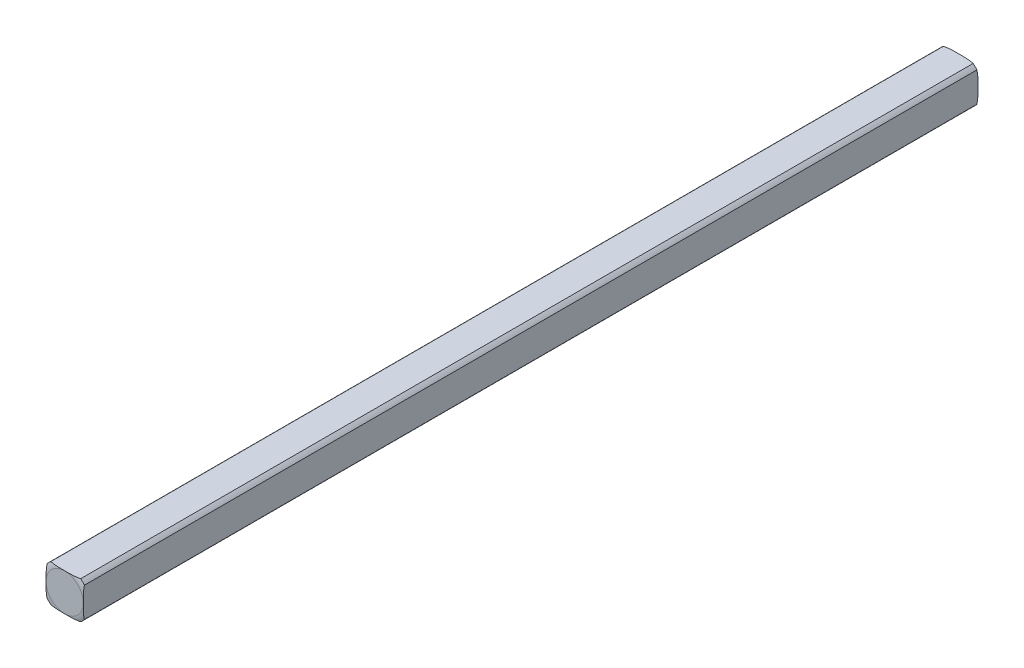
ISO-10303-21;
HEADER;
FILE_DESCRIPTION(('STEP AP214'),'2;1');
FILE_NAME('part.step','',(''),(''),'','','');
FILE_SCHEMA(('AUTOMOTIVE_DESIGN { 1 0 10303 214 1 1 1 1 }'));
ENDSEC;
DATA;
#1=APPLICATION_CONTEXT('core data for automotive mechanical design processes');
#2=APPLICATION_PROTOCOL_DEFINITION('international standard','automotive_design',2000,#1);
#3=PRODUCT_CONTEXT('',#1,'mechanical');
#4=PRODUCT('Part','Part','',(#3));
#5=PRODUCT_RELATED_PRODUCT_CATEGORY('part','',(#4));
#6=PRODUCT_DEFINITION_FORMATION('','',#4);
#7=PRODUCT_DEFINITION_CONTEXT('part definition',#1,'design');
#8=PRODUCT_DEFINITION('design','',#6,#7);
#9=PRODUCT_DEFINITION_SHAPE('','',#8);
#10=(LENGTH_UNIT() NAMED_UNIT(*) SI_UNIT(.MILLI.,.METRE.));
#11=(NAMED_UNIT(*) PLANE_ANGLE_UNIT() SI_UNIT($,.RADIAN.));
#12=(NAMED_UNIT(*) SI_UNIT($,.STERADIAN.) SOLID_ANGLE_UNIT());
#13=UNCERTAINTY_MEASURE_WITH_UNIT(LENGTH_MEASURE(1.E-05),#10,'distance_accuracy_value','');
#14=(GEOMETRIC_REPRESENTATION_CONTEXT(3) GLOBAL_UNCERTAINTY_ASSIGNED_CONTEXT((#13)) GLOBAL_UNIT_ASSIGNED_CONTEXT((#10,
#11,#12)) REPRESENTATION_CONTEXT('',''));
#15=CARTESIAN_POINT('',(0.,0.,0.));
#16=DIRECTION('',(0.,0.,1.));
#17=DIRECTION('',(1.,0.,0.));
#18=AXIS2_PLACEMENT_3D('',#15,#16,#17);
#19=CARTESIAN_POINT('',(0.,0.,38.1));
#20=DIRECTION('',(0.,0.,-1.));
#21=DIRECTION('',(-1.,0.,0.));
#22=AXIS2_PLACEMENT_3D('',#19,#20,#21);
#23=CYLINDRICAL_SURFACE('',#22,2.03199999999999);
#24=CARTESIAN_POINT('',(0.,0.,-38.007993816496));
#25=DIRECTION('',(0.,0.,1.));
#26=DIRECTION('',(1.,0.,0.));
#27=AXIS2_PLACEMENT_3D('',#24,#25,#26);
#28=CIRCLE('',#27,2.03199999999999);
#29=CARTESIAN_POINT('',(-1.26841150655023,-1.5875,-38.0079938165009));
#30=VERTEX_POINT('',#29);
#31=CARTESIAN_POINT('',(-1.5875,-1.2684115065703,-38.007993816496));
#32=VERTEX_POINT('',#31);
#33=EDGE_CURVE('E46',#30,#32,#28,.F.);
#34=ORIENTED_EDGE('',*,*,#33,.F.);
#35=DIRECTION('',(0.,0.,-1.));
#36=VECTOR('',#35,1.);
#37=CARTESIAN_POINT('',(-1.26841150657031,-1.5875,38.1));
#38=LINE('',#37,#36);
#39=CARTESIAN_POINT('',(-1.26841150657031,-1.5875,38.007993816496));
#40=VERTEX_POINT('',#39);
#41=EDGE_CURVE('E219',#40,#30,#38,.T.);
#42=ORIENTED_EDGE('',*,*,#41,.F.);
#43=CARTESIAN_POINT('',(0.,0.,38.007993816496));
#44=DIRECTION('',(0.,0.,-1.));
#45=DIRECTION('',(-1.,0.,0.));
#46=AXIS2_PLACEMENT_3D('',#43,#44,#45);
#47=CIRCLE('',#46,2.03199999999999);
#48=CARTESIAN_POINT('',(-1.5875,-1.26841150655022,38.0079938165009));
#49=VERTEX_POINT('',#48);
#50=EDGE_CURVE('E247',#49,#40,#47,.F.);
#51=ORIENTED_EDGE('',*,*,#50,.F.);
#52=DIRECTION('',(0.,0.,-1.));
#53=VECTOR('',#52,1.);
#54=CARTESIAN_POINT('',(-1.5875,-1.2684115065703,38.1));
#55=LINE('',#54,#53);
#56=EDGE_CURVE('E178',#49,#32,#55,.T.);
#57=ORIENTED_EDGE('',*,*,#56,.T.);
#58=EDGE_LOOP('',(#34,#42,#51,#57));
#59=FACE_BOUND('',#58,.T.);
#60=ADVANCED_FACE('F32',(#59),#23,.T.);
#61=CARTESIAN_POINT('',(-1.26841150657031,-1.5875,38.1));
#62=DIRECTION('',(0.,1.,0.));
#63=DIRECTION('',(-1.,0.,0.));
#64=AXIS2_PLACEMENT_3D('',#61,#62,#63);
#65=PLANE('',#64);
#66=CARTESIAN_POINT('',(0.,-1.58750000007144,-38.099871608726));
#67=CARTESIAN_POINT('',(-0.0554057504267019,-1.58750000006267,-38.09986855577));
#68=CARTESIAN_POINT('',(-0.110811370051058,-1.5875000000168,-38.0997818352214));
#69=CARTESIAN_POINT('',(-0.221622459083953,-1.58749999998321,-38.0993176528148));
#70=CARTESIAN_POINT('',(-0.277027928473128,-1.58749999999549,-38.0989401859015));
#71=CARTESIAN_POINT('',(-0.387898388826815,-1.58750000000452,-38.0975849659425));
#72=CARTESIAN_POINT('',(-0.443363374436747,-1.58750000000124,-38.0966065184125));
#73=CARTESIAN_POINT('',(-0.554262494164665,-1.58749999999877,-38.0935717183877));
#74=CARTESIAN_POINT('',(-0.609696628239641,-1.58749999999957,-38.091515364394));
#75=CARTESIAN_POINT('',(-0.774984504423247,-1.58750000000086,-38.0829165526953));
#76=CARTESIAN_POINT('',(-0.884747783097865,-1.58750000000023,-38.0739511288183));
#77=CARTESIAN_POINT('',(-1.10262741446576,-1.58749999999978,-38.0445105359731));
#78=CARTESIAN_POINT('',(-1.21074753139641,-1.58749999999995,-38.024067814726));
#79=CARTESIAN_POINT('',(-1.39423476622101,-1.58750000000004,-37.97476919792));
#80=CARTESIAN_POINT('',(-1.47058413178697,-1.58750000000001,-37.9496592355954));
#81=CARTESIAN_POINT('',(-1.61943071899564,-1.58749999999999,-37.889441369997));
#82=CARTESIAN_POINT('',(-1.6919232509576,-1.5875,-37.8543216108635));
#83=CARTESIAN_POINT('',(-1.83122441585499,-1.58750000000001,-37.7729812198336));
#84=CARTESIAN_POINT('',(-1.89798617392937,-1.58750000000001,-37.7266790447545));
#85=CARTESIAN_POINT('',(-2.02246847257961,-1.5875,-37.623112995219));
#86=CARTESIAN_POINT('',(-2.08019219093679,-1.5875,-37.5658529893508));
#87=CARTESIAN_POINT('',(-2.18247400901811,-1.5875,-37.442877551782));
#88=CARTESIAN_POINT('',(-2.22731932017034,-1.5875,-37.3774028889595));
#89=CARTESIAN_POINT('',(-2.30317924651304,-1.5875,-37.2388672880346));
#90=CARTESIAN_POINT('',(-2.3342052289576,-1.5875,-37.1658126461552));
#91=CARTESIAN_POINT('',(-2.37722723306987,-1.5875,-37.0257908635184));
#92=CARTESIAN_POINT('',(-2.39132054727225,-1.58750000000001,-36.9594624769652));
#93=CARTESIAN_POINT('',(-2.40736734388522,-1.58750000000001,-36.8253578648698));
#94=CARTESIAN_POINT('',(-2.40932606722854,-1.58750000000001,-36.7575822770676));
#95=CARTESIAN_POINT('',(-2.40127488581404,-1.58750000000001,-36.6269484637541));
#96=CARTESIAN_POINT('',(-2.3919925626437,-1.58750000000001,-36.5640438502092));
#97=CARTESIAN_POINT('',(-2.36306567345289,-1.58750000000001,-36.4406919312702));
#98=CARTESIAN_POINT('',(-2.34342428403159,-1.5875,-36.3802438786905));
#99=CARTESIAN_POINT('',(-2.29441053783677,-1.5875,-36.2629591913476));
#100=CARTESIAN_POINT('',(-2.26497188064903,-1.5875,-36.2061503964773));
#101=CARTESIAN_POINT('',(-2.19751644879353,-1.5875,-36.0978481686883));
#102=CARTESIAN_POINT('',(-2.1594926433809,-1.5875,-36.0463591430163));
#103=CARTESIAN_POINT('',(-2.07342991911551,-1.5875,-35.9464184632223));
#104=CARTESIAN_POINT('',(-2.0248927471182,-1.5875,-35.8983972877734));
#105=CARTESIAN_POINT('',(-1.92137748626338,-1.5875,-35.8101236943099));
#106=CARTESIAN_POINT('',(-1.86640709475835,-1.5875,-35.7698621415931));
#107=CARTESIAN_POINT('',(-1.72684502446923,-1.5875,-35.6814455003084));
#108=CARTESIAN_POINT('',(-1.63968161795,-1.5875,-35.6373426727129));
#109=CARTESIAN_POINT('',(-1.45917305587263,-1.5875,-35.5637163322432));
#110=CARTESIAN_POINT('',(-1.36580194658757,-1.5875,-35.5342590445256));
#111=CARTESIAN_POINT('',(-1.18810212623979,-1.5875,-35.4905238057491));
#112=CARTESIAN_POINT('',(-1.104109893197,-1.5875,-35.4748044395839));
#113=CARTESIAN_POINT('',(-0.935062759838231,-1.5875,-35.4505180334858));
#114=CARTESIAN_POINT('',(-0.850006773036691,-1.5875,-35.4419590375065));
#115=CARTESIAN_POINT('',(-0.679054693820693,-1.5875,-35.4296195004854));
#116=CARTESIAN_POINT('',(-0.593156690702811,-1.5875,-35.4258695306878));
#117=CARTESIAN_POINT('',(-0.421340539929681,-1.5875,-35.4209919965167));
#118=CARTESIAN_POINT('',(-0.335422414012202,-1.5875,-35.4198633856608));
#119=CARTESIAN_POINT('',(-0.16269939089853,-1.5875,-35.4185595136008));
#120=CARTESIAN_POINT('',(-0.075894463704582,-1.5875,-35.418394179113));
#121=CARTESIAN_POINT('',(0.0977353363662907,-1.5875,-35.4184349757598));
#122=CARTESIAN_POINT('',(0.184560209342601,-1.5875,-35.4186411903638));
#123=CARTESIAN_POINT('',(0.357896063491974,-1.5875,-35.4201380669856));
#124=CARTESIAN_POINT('',(0.444407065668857,-1.5875,-35.4214248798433));
#125=CARTESIAN_POINT('',(0.617328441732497,-1.5875,-35.4268451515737));
#126=CARTESIAN_POINT('',(0.703738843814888,-1.5875,-35.4309772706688));
#127=CARTESIAN_POINT('',(0.852851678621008,-1.5875,-35.4425965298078));
#128=CARTESIAN_POINT('',(0.915642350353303,-1.5875,-35.4488732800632));
#129=CARTESIAN_POINT('',(1.04078663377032,-1.5875,-35.4651359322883));
#130=CARTESIAN_POINT('',(1.10314005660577,-1.5875,-35.4751233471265));
#131=CARTESIAN_POINT('',(1.22634455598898,-1.5875,-35.4996010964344));
#132=CARTESIAN_POINT('',(1.28720438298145,-1.5875,-35.5140460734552));
#133=CARTESIAN_POINT('',(1.4073953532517,-1.5875,-35.5482476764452));
#134=CARTESIAN_POINT('',(1.46672725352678,-1.5875,-35.5680016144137));
#135=CARTESIAN_POINT('',(1.60202842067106,-1.5875,-35.6208853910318));
#136=CARTESIAN_POINT('',(1.67714329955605,-1.5875,-35.6562757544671));
#137=CARTESIAN_POINT('',(1.82116214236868,-1.5875,-35.7386318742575));
#138=CARTESIAN_POINT('',(1.89004518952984,-1.5875,-35.7856347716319));
#139=CARTESIAN_POINT('',(2.01894189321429,-1.5875,-35.8916547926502));
#140=CARTESIAN_POINT('',(2.07887766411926,-1.5875,-35.950767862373));
#141=CARTESIAN_POINT('',(2.18588884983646,-1.5875,-36.0795971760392));
#142=CARTESIAN_POINT('',(2.23298984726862,-1.5875,-36.1492918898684));
#143=CARTESIAN_POINT('',(2.30612941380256,-1.5875,-36.2868330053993));
#144=CARTESIAN_POINT('',(2.3341740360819,-1.5875,-36.3536148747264));
#145=CARTESIAN_POINT('',(2.37720788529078,-1.5875,-36.4912819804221));
#146=CARTESIAN_POINT('',(2.39220173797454,-1.5875,-36.5621657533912));
#147=CARTESIAN_POINT('',(2.40750215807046,-1.5875,-36.6981093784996));
#148=CARTESIAN_POINT('',(2.40915762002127,-1.5875,-36.7630207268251));
#149=CARTESIAN_POINT('',(2.40125072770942,-1.5875,-36.8921402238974));
#150=CARTESIAN_POINT('',(2.39169228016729,-1.5875,-36.9563486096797));
#151=CARTESIAN_POINT('',(2.36214622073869,-1.5875,-37.0806619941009));
#152=CARTESIAN_POINT('',(2.34241580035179,-1.5875,-37.1408286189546));
#153=CARTESIAN_POINT('',(2.29348050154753,-1.5875,-37.2571601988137));
#154=CARTESIAN_POINT('',(2.26427507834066,-1.5875,-37.313324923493));
#155=CARTESIAN_POINT('',(2.19625635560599,-1.5875,-37.4223847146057));
#156=CARTESIAN_POINT('',(2.15712846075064,-1.5875,-37.4750828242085));
#157=CARTESIAN_POINT('',(2.07130481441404,-1.5875,-37.5738859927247));
#158=CARTESIAN_POINT('',(2.02460625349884,-1.5875,-37.6199885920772));
#159=CARTESIAN_POINT('',(1.92025370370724,-1.5875,-37.709271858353));
#160=CARTESIAN_POINT('',(1.86197368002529,-1.5875,-37.7517173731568));
#161=CARTESIAN_POINT('',(1.74003768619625,-1.5875,-37.8279280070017));
#162=CARTESIAN_POINT('',(1.6763807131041,-1.58749999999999,-37.8616915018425));
#163=CARTESIAN_POINT('',(1.55771714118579,-1.58750000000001,-37.9154094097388));
#164=CARTESIAN_POINT('',(1.50333219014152,-1.58750000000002,-37.9367664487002));
#165=CARTESIAN_POINT('',(1.39285109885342,-1.58749999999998,-37.9745182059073));
#166=CARTESIAN_POINT('',(1.33675399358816,-1.58749999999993,-37.9909100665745));
#167=CARTESIAN_POINT('',(1.16664195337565,-1.58750000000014,-38.0335143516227));
#168=CARTESIAN_POINT('',(1.05096980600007,-1.58750000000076,-38.053086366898));
#169=CARTESIAN_POINT('',(0.857386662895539,-1.58749999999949,-38.0756496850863));
#170=CARTESIAN_POINT('',(0.779775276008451,-1.58749999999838,-38.0819962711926));
#171=CARTESIAN_POINT('',(0.624312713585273,-1.58750000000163,-38.0911703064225));
#172=CARTESIAN_POINT('',(0.546461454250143,-1.587500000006,-38.0939963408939));
#173=CARTESIAN_POINT('',(0.390495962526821,-1.58749999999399,-38.0977362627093));
#174=CARTESIAN_POINT('',(0.312381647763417,-1.58749999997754,-38.0986443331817));
#175=CARTESIAN_POINT('',(0.156178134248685,-1.58750000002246,-38.099714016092));
#176=CARTESIAN_POINT('',(0.0780889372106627,-1.5875000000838,-38.0998759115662));
#177=CARTESIAN_POINT('',(0.,-1.58750000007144,-38.099871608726));
#178=B_SPLINE_CURVE_WITH_KNOTS('',3,(#66,#67,#68,#69,#70,#71,#72,#73,#74,#75,#76,#77,#78,#79,
#80,#81,#82,#83,#84,#85,#86,#87,#88,#89,#90,#91,#92,#93,#94,#95,#96,#97,#98,#99,#100,#101,#102,
#103,#104,#105,#106,#107,#108,#109,#110,#111,#112,#113,#114,#115,#116,#117,#118,#119,#120,#121,
#122,#123,#124,#125,#126,#127,#128,#129,#130,#131,#132,#133,#134,#135,#136,#137,#138,#139,#140,
#141,#142,#143,#144,#145,#146,#147,#148,#149,#150,#151,#152,#153,#154,#155,#156,#157,#158,#159,
#160,#161,#162,#163,#164,#165,#166,#167,#168,#169,#170,#171,#172,#173,#174,#175,#176,#177),
.UNSPECIFIED.,.T.,.F.,(4,2,2,2,2,2,2,2,2,2,2,2,2,2,2,2,2,2,2,2,2,2,2,2,2,2,2,2,2,2,2,2,2,2,2,2,
2,2,2,2,2,2,2,2,2,2,2,2,2,2,2,2,2,2,2,4),(0.,0.166216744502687,0.332436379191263,
0.498848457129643,0.665260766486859,0.995315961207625,1.32444271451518,1.56497446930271,
1.80579230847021,2.04842225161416,2.29096669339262,2.52758515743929,2.76400862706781,
2.96637931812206,3.16866259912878,3.35852409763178,3.54832740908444,3.73944220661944,
3.93071408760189,4.1347209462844,4.33848615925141,4.62988657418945,4.9225929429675,
5.17855082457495,5.43479586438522,5.6926619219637,5.95042501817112,6.21083976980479,
6.47131303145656,6.73086238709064,6.99028961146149,7.17951817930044,7.36882398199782,
7.55626372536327,7.743608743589,7.99179472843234,8.24078501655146,8.49183009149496,
8.74237105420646,8.95844803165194,9.17444839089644,9.36829054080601,9.56206517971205,
9.75116456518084,9.94027482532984,10.1363589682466,10.3325160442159,10.5479952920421,
10.7635148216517,10.9385445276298,11.113674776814,11.4644612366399,11.6980148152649,
11.9316622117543,12.1660172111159,12.4002833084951),.UNSPECIFIED.);
#179=CARTESIAN_POINT('',(1.26841150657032,-1.5875,-38.007993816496));
#180=VERTEX_POINT('',#179);
#181=EDGE_CURVE('E185',#180,#30,#178,.T.);
#182=ORIENTED_EDGE('',*,*,#181,.F.);
#183=DIRECTION('',(0.,0.,-1.));
#184=VECTOR('',#183,1.);
#185=CARTESIAN_POINT('',(1.26841150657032,-1.5875,38.1));
#186=LINE('',#185,#184);
#187=CARTESIAN_POINT('',(1.26841150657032,-1.5875,38.007993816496));
#188=VERTEX_POINT('',#187);
#189=EDGE_CURVE('E225',#188,#180,#186,.T.);
#190=ORIENTED_EDGE('',*,*,#189,.F.);
#191=CARTESIAN_POINT('',(0.,-1.58750000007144,38.099871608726));
#192=CARTESIAN_POINT('',(0.0554057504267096,-1.58750000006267,38.09986855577));
#193=CARTESIAN_POINT('',(0.110811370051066,-1.5875000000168,38.0997818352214));
#194=CARTESIAN_POINT('',(0.221622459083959,-1.58749999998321,38.0993176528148));
#195=CARTESIAN_POINT('',(0.277027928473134,-1.58749999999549,38.0989401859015));
#196=CARTESIAN_POINT('',(0.38789838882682,-1.58750000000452,38.0975849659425));
#197=CARTESIAN_POINT('',(0.443363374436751,-1.58750000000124,38.0966065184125));
#198=CARTESIAN_POINT('',(0.554262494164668,-1.58749999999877,38.0935717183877));
#199=CARTESIAN_POINT('',(0.609696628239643,-1.58749999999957,38.091515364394));
#200=CARTESIAN_POINT('',(0.774984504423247,-1.58750000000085,38.0829165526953));
#201=CARTESIAN_POINT('',(0.884747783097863,-1.58750000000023,38.0739511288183));
#202=CARTESIAN_POINT('',(1.10262741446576,-1.58749999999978,38.0445105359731));
#203=CARTESIAN_POINT('',(1.2107475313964,-1.58749999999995,38.024067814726));
#204=CARTESIAN_POINT('',(1.39423476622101,-1.58750000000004,37.97476919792));
#205=CARTESIAN_POINT('',(1.47058413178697,-1.58750000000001,37.9496592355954));
#206=CARTESIAN_POINT('',(1.61943071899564,-1.58749999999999,37.889441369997));
#207=CARTESIAN_POINT('',(1.6919232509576,-1.5875,37.8543216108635));
#208=CARTESIAN_POINT('',(1.83122441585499,-1.5875,37.7729812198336));
#209=CARTESIAN_POINT('',(1.89798617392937,-1.5875,37.7266790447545));
#210=CARTESIAN_POINT('',(2.02246847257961,-1.5875,37.623112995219));
#211=CARTESIAN_POINT('',(2.08019219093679,-1.5875,37.5658529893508));
#212=CARTESIAN_POINT('',(2.18247400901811,-1.5875,37.442877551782));
#213=CARTESIAN_POINT('',(2.22731932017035,-1.5875,37.3774028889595));
#214=CARTESIAN_POINT('',(2.30317924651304,-1.5875,37.2388672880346));
#215=CARTESIAN_POINT('',(2.3342052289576,-1.5875,37.1658126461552));
#216=CARTESIAN_POINT('',(2.37722723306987,-1.5875,37.0257908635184));
#217=CARTESIAN_POINT('',(2.39132054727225,-1.5875,36.9594624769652));
#218=CARTESIAN_POINT('',(2.40736734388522,-1.5875,36.8253578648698));
#219=CARTESIAN_POINT('',(2.40932606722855,-1.5875,36.7575822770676));
#220=CARTESIAN_POINT('',(2.40127488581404,-1.5875,36.6269484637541));
#221=CARTESIAN_POINT('',(2.3919925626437,-1.5875,36.5640438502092));
#222=CARTESIAN_POINT('',(2.3630656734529,-1.5875,36.4406919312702));
#223=CARTESIAN_POINT('',(2.34342428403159,-1.5875,36.3802438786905));
#224=CARTESIAN_POINT('',(2.29441053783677,-1.5875,36.2629591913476));
#225=CARTESIAN_POINT('',(2.26497188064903,-1.5875,36.2061503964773));
#226=CARTESIAN_POINT('',(2.19751644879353,-1.5875,36.0978481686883));
#227=CARTESIAN_POINT('',(2.1594926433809,-1.5875,36.0463591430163));
#228=CARTESIAN_POINT('',(2.07342991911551,-1.5875,35.9464184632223));
#229=CARTESIAN_POINT('',(2.02489274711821,-1.5875,35.8983972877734));
#230=CARTESIAN_POINT('',(1.92137748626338,-1.5875,35.8101236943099));
#231=CARTESIAN_POINT('',(1.86640709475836,-1.5875,35.7698621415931));
#232=CARTESIAN_POINT('',(1.72684502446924,-1.5875,35.6814455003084));
#233=CARTESIAN_POINT('',(1.63968161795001,-1.5875,35.6373426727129));
#234=CARTESIAN_POINT('',(1.45917305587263,-1.5875,35.5637163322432));
#235=CARTESIAN_POINT('',(1.36580194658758,-1.5875,35.5342590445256));
#236=CARTESIAN_POINT('',(1.18810212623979,-1.5875,35.4905238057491));
#237=CARTESIAN_POINT('',(1.10410989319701,-1.5875,35.4748044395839));
#238=CARTESIAN_POINT('',(0.935062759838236,-1.5875,35.4505180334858));
#239=CARTESIAN_POINT('',(0.850006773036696,-1.5875,35.4419590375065));
#240=CARTESIAN_POINT('',(0.679054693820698,-1.5875,35.4296195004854));
#241=CARTESIAN_POINT('',(0.593156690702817,-1.5875,35.4258695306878));
#242=CARTESIAN_POINT('',(0.421340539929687,-1.5875,35.4209919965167));
#243=CARTESIAN_POINT('',(0.335422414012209,-1.5875,35.4198633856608));
#244=CARTESIAN_POINT('',(0.162699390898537,-1.5875,35.4185595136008));
#245=CARTESIAN_POINT('',(0.0758944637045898,-1.5875,35.418394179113));
#246=CARTESIAN_POINT('',(-0.0977353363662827,-1.5875,35.4184349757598));
#247=CARTESIAN_POINT('',(-0.184560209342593,-1.5875,35.4186411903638));
#248=CARTESIAN_POINT('',(-0.357896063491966,-1.5875,35.4201380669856));
#249=CARTESIAN_POINT('',(-0.444407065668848,-1.5875,35.4214248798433));
#250=CARTESIAN_POINT('',(-0.617328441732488,-1.5875,35.4268451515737));
#251=CARTESIAN_POINT('',(-0.703738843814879,-1.5875,35.4309772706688));
#252=CARTESIAN_POINT('',(-0.852851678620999,-1.5875,35.4425965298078));
#253=CARTESIAN_POINT('',(-0.915642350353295,-1.5875,35.4488732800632));
#254=CARTESIAN_POINT('',(-1.04078663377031,-1.5875,35.4651359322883));
#255=CARTESIAN_POINT('',(-1.10314005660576,-1.5875,35.4751233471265));
#256=CARTESIAN_POINT('',(-1.22634455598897,-1.5875,35.4996010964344));
#257=CARTESIAN_POINT('',(-1.28720438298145,-1.5875,35.5140460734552));
#258=CARTESIAN_POINT('',(-1.40739535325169,-1.5875,35.5482476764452));
#259=CARTESIAN_POINT('',(-1.46672725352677,-1.5875,35.5680016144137));
#260=CARTESIAN_POINT('',(-1.60202842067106,-1.5875,35.6208853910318));
#261=CARTESIAN_POINT('',(-1.67714329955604,-1.5875,35.6562757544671));
#262=CARTESIAN_POINT('',(-1.82116214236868,-1.5875,35.7386318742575));
#263=CARTESIAN_POINT('',(-1.89004518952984,-1.5875,35.7856347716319));
#264=CARTESIAN_POINT('',(-2.01894189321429,-1.5875,35.8916547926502));
#265=CARTESIAN_POINT('',(-2.07887766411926,-1.5875,35.9507678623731));
#266=CARTESIAN_POINT('',(-2.18588884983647,-1.5875,36.0795971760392));
#267=CARTESIAN_POINT('',(-2.23298984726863,-1.5875,36.1492918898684));
#268=CARTESIAN_POINT('',(-2.30612941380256,-1.5875,36.2868330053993));
#269=CARTESIAN_POINT('',(-2.3341740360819,-1.5875,36.3536148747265));
#270=CARTESIAN_POINT('',(-2.37720788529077,-1.5875,36.4912819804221));
#271=CARTESIAN_POINT('',(-2.39220173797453,-1.58750000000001,36.5621657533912));
#272=CARTESIAN_POINT('',(-2.40750215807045,-1.58750000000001,36.6981093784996));
#273=CARTESIAN_POINT('',(-2.40915762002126,-1.58750000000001,36.7630207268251));
#274=CARTESIAN_POINT('',(-2.40125072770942,-1.58750000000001,36.8921402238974));
#275=CARTESIAN_POINT('',(-2.39169228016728,-1.58750000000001,36.9563486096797));
#276=CARTESIAN_POINT('',(-2.36214622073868,-1.58750000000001,37.0806619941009));
#277=CARTESIAN_POINT('',(-2.34241580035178,-1.5875,37.1408286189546));
#278=CARTESIAN_POINT('',(-2.29348050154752,-1.5875,37.2571601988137));
#279=CARTESIAN_POINT('',(-2.26427507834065,-1.5875,37.313324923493));
#280=CARTESIAN_POINT('',(-2.19625635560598,-1.5875,37.4223847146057));
#281=CARTESIAN_POINT('',(-2.15712846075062,-1.5875,37.4750828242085));
#282=CARTESIAN_POINT('',(-2.07130481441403,-1.5875,37.5738859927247));
#283=CARTESIAN_POINT('',(-2.02460625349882,-1.5875,37.6199885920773));
#284=CARTESIAN_POINT('',(-1.92025370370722,-1.5875,37.709271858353));
#285=CARTESIAN_POINT('',(-1.86197368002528,-1.58750000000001,37.7517173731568));
#286=CARTESIAN_POINT('',(-1.74003768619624,-1.5875,37.8279280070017));
#287=CARTESIAN_POINT('',(-1.67638071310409,-1.5875,37.8616915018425));
#288=CARTESIAN_POINT('',(-1.55771714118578,-1.58750000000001,37.9154094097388));
#289=CARTESIAN_POINT('',(-1.5033321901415,-1.58750000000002,37.9367664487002));
#290=CARTESIAN_POINT('',(-1.3928510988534,-1.58749999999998,37.9745182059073));
#291=CARTESIAN_POINT('',(-1.33675399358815,-1.58749999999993,37.9909100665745));
#292=CARTESIAN_POINT('',(-1.16664195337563,-1.58750000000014,38.0335143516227));
#293=CARTESIAN_POINT('',(-1.05096980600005,-1.58750000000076,38.0530863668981));
#294=CARTESIAN_POINT('',(-0.857386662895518,-1.5874999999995,38.0756496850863));
#295=CARTESIAN_POINT('',(-0.779775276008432,-1.58749999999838,38.0819962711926));
#296=CARTESIAN_POINT('',(-0.624312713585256,-1.58750000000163,38.0911703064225));
#297=CARTESIAN_POINT('',(-0.546461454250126,-1.587500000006,38.0939963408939));
#298=CARTESIAN_POINT('',(-0.390495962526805,-1.58749999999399,38.0977362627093));
#299=CARTESIAN_POINT('',(-0.312381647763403,-1.58749999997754,38.0986443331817));
#300=CARTESIAN_POINT('',(-0.156178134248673,-1.58750000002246,38.099714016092));
#301=CARTESIAN_POINT('',(-0.0780889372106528,-1.5875000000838,38.0998759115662));
#302=CARTESIAN_POINT('',(0.,-1.58750000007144,38.099871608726));
#303=B_SPLINE_CURVE_WITH_KNOTS('',3,(#191,#192,#193,#194,#195,#196,#197,#198,#199,#200,#201,
#202,#203,#204,#205,#206,#207,#208,#209,#210,#211,#212,#213,#214,#215,#216,#217,#218,#219,#220,
#221,#222,#223,#224,#225,#226,#227,#228,#229,#230,#231,#232,#233,#234,#235,#236,#237,#238,#239,
#240,#241,#242,#243,#244,#245,#246,#247,#248,#249,#250,#251,#252,#253,#254,#255,#256,#257,#258,
#259,#260,#261,#262,#263,#264,#265,#266,#267,#268,#269,#270,#271,#272,#273,#274,#275,#276,#277,
#278,#279,#280,#281,#282,#283,#284,#285,#286,#287,#288,#289,#290,#291,#292,#293,#294,#295,#296,
#297,#298,#299,#300,#301,#302),.UNSPECIFIED.,.T.,.F.,(4,2,2,2,2,2,2,2,2,2,2,2,2,2,2,2,2,2,2,2,2,
2,2,2,2,2,2,2,2,2,2,2,2,2,2,2,2,2,2,2,2,2,2,2,2,2,2,2,2,2,2,2,2,2,2,4),(0.,0.166216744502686,
0.33243637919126,0.498848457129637,0.665260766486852,0.995315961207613,1.32444271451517,
1.5649744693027,1.8057923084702,2.04842225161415,2.29096669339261,2.52758515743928,
2.7640086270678,2.96637931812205,3.16866259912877,3.35852409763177,3.54832740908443,
3.73944220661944,3.93071408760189,4.13472094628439,4.33848615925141,4.62988657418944,
4.9225929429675,5.17855082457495,5.43479586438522,5.69266192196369,5.95042501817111,
6.21083976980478,6.47131303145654,6.73086238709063,6.99028961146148,7.17951817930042,
7.36882398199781,7.55626372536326,7.74360874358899,7.99179472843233,8.24078501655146,
8.49183009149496,8.74237105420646,8.95844803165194,9.17444839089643,9.368290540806,
9.56206517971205,9.75116456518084,9.94027482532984,10.1363589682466,10.3325160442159,
10.5479952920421,10.7635148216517,10.9385445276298,11.113674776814,11.4644612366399,
11.6980148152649,11.9316622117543,12.1660172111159,12.400283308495),.UNSPECIFIED.);
#304=EDGE_CURVE('E174',#40,#188,#303,.T.);
#305=ORIENTED_EDGE('',*,*,#304,.F.);
#306=ORIENTED_EDGE('',*,*,#41,.T.);
#307=EDGE_LOOP('',(#182,#190,#305,#306));
#308=FACE_BOUND('',#307,.T.);
#309=ADVANCED_FACE('F180',(#308),#65,.F.);
#310=CARTESIAN_POINT('',(0.,0.,38.1));
#311=DIRECTION('',(0.,0.,-1.));
#312=DIRECTION('',(-1.,0.,0.));
#313=AXIS2_PLACEMENT_3D('',#310,#311,#312);
#314=CYLINDRICAL_SURFACE('',#313,2.032);
#315=CARTESIAN_POINT('',(0.,0.,-38.007993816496));
#316=DIRECTION('',(0.,0.,1.));
#317=DIRECTION('',(1.,0.,0.));
#318=AXIS2_PLACEMENT_3D('',#315,#316,#317);
#319=CIRCLE('',#318,2.032);
#320=CARTESIAN_POINT('',(1.5875,-1.26841150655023,-38.0079938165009));
#321=VERTEX_POINT('',#320);
#322=EDGE_CURVE('E155',#321,#180,#319,.F.);
#323=ORIENTED_EDGE('',*,*,#322,.F.);
#324=DIRECTION('',(0.,0.,-1.));
#325=VECTOR('',#324,1.);
#326=CARTESIAN_POINT('',(1.5875,-1.26841150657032,38.1));
#327=LINE('',#326,#325);
#328=CARTESIAN_POINT('',(1.5875,-1.26841150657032,38.007993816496));
#329=VERTEX_POINT('',#328);
#330=EDGE_CURVE('E228',#329,#321,#327,.T.);
#331=ORIENTED_EDGE('',*,*,#330,.F.);
#332=CARTESIAN_POINT('',(0.,0.,38.007993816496));
#333=DIRECTION('',(0.,0.,-1.));
#334=DIRECTION('',(-1.,0.,0.));
#335=AXIS2_PLACEMENT_3D('',#332,#333,#334);
#336=CIRCLE('',#335,2.032);
#337=EDGE_CURVE('E170',#188,#329,#336,.F.);
#338=ORIENTED_EDGE('',*,*,#337,.F.);
#339=ORIENTED_EDGE('',*,*,#189,.T.);
#340=EDGE_LOOP('',(#323,#331,#338,#339));
#341=FACE_BOUND('',#340,.T.);
#342=ADVANCED_FACE('F161',(#341),#314,.T.);
#343=CARTESIAN_POINT('',(1.5875,-1.26841150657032,38.1));
#344=DIRECTION('',(-1.,0.,0.));
#345=DIRECTION('',(0.,0.,1.));
#346=AXIS2_PLACEMENT_3D('',#343,#344,#345);
#347=PLANE('',#346);
#348=CARTESIAN_POINT('',(1.5875,0.,-38.099871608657));
#349=CARTESIAN_POINT('',(1.5875,-0.0554057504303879,-38.0998685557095));
#350=CARTESIAN_POINT('',(1.5875,-0.110811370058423,-38.0997818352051));
#351=CARTESIAN_POINT('',(1.5875,-0.221622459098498,-38.099317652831));
#352=CARTESIAN_POINT('',(1.5875,-0.277027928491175,-38.0989401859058));
#353=CARTESIAN_POINT('',(1.5875,-0.387898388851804,-38.0975849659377));
#354=CARTESIAN_POINT('',(1.5875,-0.443363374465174,-38.0966065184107));
#355=CARTESIAN_POINT('',(1.5875,-0.554262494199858,-38.0935717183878));
#356=CARTESIAN_POINT('',(1.5875,-0.609696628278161,-38.0915153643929));
#357=CARTESIAN_POINT('',(1.5875,-0.774984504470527,-38.0829165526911));
#358=CARTESIAN_POINT('',(1.5875,-0.884747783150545,-38.0739511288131));
#359=CARTESIAN_POINT('',(1.5875,-1.10262741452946,-38.0445105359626));
#360=CARTESIAN_POINT('',(1.5875,-1.21074753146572,-38.0240678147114));
#361=CARTESIAN_POINT('',(1.5875,-1.39423476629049,-37.9747691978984));
#362=CARTESIAN_POINT('',(1.5875,-1.47058413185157,-37.9496592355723));
#363=CARTESIAN_POINT('',(1.5875,-1.61943071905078,-37.8894413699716));
#364=CARTESIAN_POINT('',(1.5875,-1.69192325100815,-37.8543216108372));
#365=CARTESIAN_POINT('',(1.5875,-1.83122441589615,-37.7729812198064));
#366=CARTESIAN_POINT('',(1.5875,-1.89798617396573,-37.7266790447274));
#367=CARTESIAN_POINT('',(1.5875,-2.02246847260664,-37.6231129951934));
#368=CARTESIAN_POINT('',(1.5875,-2.08019219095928,-37.5658529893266));
#369=CARTESIAN_POINT('',(1.5875,-2.1824740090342,-37.4428775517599));
#370=CARTESIAN_POINT('',(1.5875,-2.22731932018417,-37.3774028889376));
#371=CARTESIAN_POINT('',(1.5875,-2.30317924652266,-37.2388672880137));
#372=CARTESIAN_POINT('',(1.5875,-2.33420522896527,-37.165812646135));
#373=CARTESIAN_POINT('',(1.5875,-2.37722723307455,-37.0257908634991));
#374=CARTESIAN_POINT('',(1.5875,-2.3913205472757,-36.9594624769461));
#375=CARTESIAN_POINT('',(1.5875,-2.4073673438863,-36.8253578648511));
#376=CARTESIAN_POINT('',(1.5875,-2.4093260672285,-36.7575822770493));
#377=CARTESIAN_POINT('',(1.5875,-2.40127488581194,-36.6269484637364));
#378=CARTESIAN_POINT('',(1.5875,-2.39199256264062,-36.5640438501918));
#379=CARTESIAN_POINT('',(1.5875,-2.36306567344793,-36.4406919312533));
#380=CARTESIAN_POINT('',(1.5875,-2.34342428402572,-36.3802438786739));
#381=CARTESIAN_POINT('',(1.5875,-2.29441053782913,-36.2629591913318));
#382=CARTESIAN_POINT('',(1.5875,-2.2649718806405,-36.2061503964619));
#383=CARTESIAN_POINT('',(1.5875,-2.1975164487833,-36.0978481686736));
#384=CARTESIAN_POINT('',(1.5875,-2.15949264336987,-36.0463591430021));
#385=CARTESIAN_POINT('',(1.5875,-2.07342991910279,-35.946418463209));
#386=CARTESIAN_POINT('',(1.5875,-2.02489274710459,-35.8983972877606));
#387=CARTESIAN_POINT('',(1.5875,-1.92137748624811,-35.8101236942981));
#388=CARTESIAN_POINT('',(1.5875,-1.86640709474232,-35.7698621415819));
#389=CARTESIAN_POINT('',(1.5875,-1.72684502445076,-35.6814455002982));
#390=CARTESIAN_POINT('',(1.5875,-1.63968161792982,-35.6373426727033));
#391=CARTESIAN_POINT('',(1.5875,-1.45917305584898,-35.5637163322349));
#392=CARTESIAN_POINT('',(1.5875,-1.36580194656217,-35.5342590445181));
#393=CARTESIAN_POINT('',(1.5875,-1.18810212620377,-35.4905238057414));
#394=CARTESIAN_POINT('',(1.5875,-1.10410989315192,-35.4748044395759));
#395=CARTESIAN_POINT('',(1.5875,-0.935062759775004,-35.4505180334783));
#396=CARTESIAN_POINT('',(1.5875,-0.850006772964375,-35.4419590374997));
#397=CARTESIAN_POINT('',(1.5875,-0.679054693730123,-35.4296195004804));
#398=CARTESIAN_POINT('',(1.5875,-0.593156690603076,-35.4258695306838));
#399=CARTESIAN_POINT('',(1.5875,-0.421340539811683,-35.4209919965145));
#400=CARTESIAN_POINT('',(1.5875,-0.335422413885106,-35.4198633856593));
#401=CARTESIAN_POINT('',(1.5875,-0.162699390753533,-35.4185595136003));
#402=CARTESIAN_POINT('',(1.5875,-0.0758944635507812,-35.4183941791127));
#403=CARTESIAN_POINT('',(1.5875,0.0977353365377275,-35.4184349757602));
#404=CARTESIAN_POINT('',(1.5875,0.18456020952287,-35.4186411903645));
#405=CARTESIAN_POINT('',(1.5875,0.357896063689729,-35.4201380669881));
#406=CARTESIAN_POINT('',(1.5875,0.444407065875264,-35.4214248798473));
#407=CARTESIAN_POINT('',(1.5875,0.617328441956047,-35.4268451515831));
#408=CARTESIAN_POINT('',(1.5875,0.703738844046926,-35.430977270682));
#409=CARTESIAN_POINT('',(1.5875,0.852851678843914,-35.4425965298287));
#410=CARTESIAN_POINT('',(1.5875,0.915642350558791,-35.4488732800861));
#411=CARTESIAN_POINT('',(1.5875,1.04078663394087,-35.4651359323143));
#412=CARTESIAN_POINT('',(1.5875,1.1031400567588,-35.4751233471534));
#413=CARTESIAN_POINT('',(1.5875,1.22634455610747,-35.4996010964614));
#414=CARTESIAN_POINT('',(1.5875,1.28720438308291,-35.5140460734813));
#415=CARTESIAN_POINT('',(1.5875,1.40739535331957,-35.5482476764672));
#416=CARTESIAN_POINT('',(1.5875,1.4667272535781,-35.5680016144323));
#417=CARTESIAN_POINT('',(1.5875,1.60202842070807,-35.6208853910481));
#418=CARTESIAN_POINT('',(1.5875,1.67714329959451,-35.6562757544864));
#419=CARTESIAN_POINT('',(1.5875,1.82116214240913,-35.7386318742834));
#420=CARTESIAN_POINT('',(1.5875,1.89004518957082,-35.7856347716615));
#421=CARTESIAN_POINT('',(1.5875,2.0189418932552,-35.891654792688));
#422=CARTESIAN_POINT('',(1.5875,2.07887766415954,-35.9507678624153));
#423=CARTESIAN_POINT('',(1.5875,2.18588884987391,-36.0795971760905));
#424=CARTESIAN_POINT('',(1.5875,2.23298984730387,-36.1492918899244));
#425=CARTESIAN_POINT('',(1.5875,2.30612941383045,-36.2868330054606));
#426=CARTESIAN_POINT('',(1.5875,2.33417403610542,-36.3536148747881));
#427=CARTESIAN_POINT('',(1.5875,2.37720788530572,-36.4912819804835));
#428=CARTESIAN_POINT('',(1.5875,2.39220173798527,-36.5621657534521));
#429=CARTESIAN_POINT('',(1.5875,2.40750215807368,-36.6981093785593));
#430=CARTESIAN_POINT('',(1.5875,2.40915762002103,-36.7630207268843));
#431=CARTESIAN_POINT('',(1.5875,2.40125072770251,-36.892140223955));
#432=CARTESIAN_POINT('',(1.5875,2.39169228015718,-36.9563486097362));
#433=CARTESIAN_POINT('',(1.5875,2.36214622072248,-37.0806619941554));
#434=CARTESIAN_POINT('',(1.5875,2.34241580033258,-37.1408286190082));
#435=CARTESIAN_POINT('',(1.5875,2.29348050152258,-37.2571601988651));
#436=CARTESIAN_POINT('',(1.5875,2.26427507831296,-37.3133249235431));
#437=CARTESIAN_POINT('',(1.5875,2.19625635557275,-37.4223847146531));
#438=CARTESIAN_POINT('',(1.5875,2.15712846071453,-37.4750828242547));
#439=CARTESIAN_POINT('',(1.5875,2.07130481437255,-37.5738859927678));
#440=CARTESIAN_POINT('',(1.5875,2.02460625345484,-37.6199885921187));
#441=CARTESIAN_POINT('',(1.5875,1.92025370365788,-37.709271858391));
#442=CARTESIAN_POINT('',(1.5875,1.86197367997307,-37.751717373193));
#443=CARTESIAN_POINT('',(1.5875,1.74003768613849,-37.8279280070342));
#444=CARTESIAN_POINT('',(1.5875,1.67638071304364,-37.8616915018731));
#445=CARTESIAN_POINT('',(1.5875,1.55771714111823,-37.9154094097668));
#446=CARTESIAN_POINT('',(1.5875,1.50333219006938,-37.9367664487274));
#447=CARTESIAN_POINT('',(1.5875,1.39285109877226,-37.9745182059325));
#448=CARTESIAN_POINT('',(1.5875,1.33675399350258,-37.9909100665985));
#449=CARTESIAN_POINT('',(1.5875,1.16664195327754,-38.0335143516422));
#450=CARTESIAN_POINT('',(1.5875,1.0509698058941,-38.0530863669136));
#451=CARTESIAN_POINT('',(1.5875,0.857386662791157,-38.0756496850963));
#452=CARTESIAN_POINT('',(1.5875,0.779775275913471,-38.0819962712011));
#453=CARTESIAN_POINT('',(1.5875,0.624312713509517,-38.0911703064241));
#454=CARTESIAN_POINT('',(1.5875,0.546461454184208,-38.0939963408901));
#455=CARTESIAN_POINT('',(1.5875,0.390495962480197,-38.0977362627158));
#456=CARTESIAN_POINT('',(1.5875,0.312381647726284,-38.0986443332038));
#457=CARTESIAN_POINT('',(1.5875,0.156178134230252,-38.0997140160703));
#458=CARTESIAN_POINT('',(1.5875,0.0780889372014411,-38.0998759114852));
#459=CARTESIAN_POINT('',(1.5875,0.,-38.099871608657));
#460=B_SPLINE_CURVE_WITH_KNOTS('',3,(#348,#349,#350,#351,#352,#353,#354,#355,#356,#357,#358,
#359,#360,#361,#362,#363,#364,#365,#366,#367,#368,#369,#370,#371,#372,#373,#374,#375,#376,#377,
#378,#379,#380,#381,#382,#383,#384,#385,#386,#387,#388,#389,#390,#391,#392,#393,#394,#395,#396,
#397,#398,#399,#400,#401,#402,#403,#404,#405,#406,#407,#408,#409,#410,#411,#412,#413,#414,#415,
#416,#417,#418,#419,#420,#421,#422,#423,#424,#425,#426,#427,#428,#429,#430,#431,#432,#433,#434,
#435,#436,#437,#438,#439,#440,#441,#442,#443,#444,#445,#446,#447,#448,#449,#450,#451,#452,#453,
#454,#455,#456,#457,#458,#459),.UNSPECIFIED.,.T.,.F.,(4,2,2,2,2,2,2,2,2,2,2,2,2,2,2,2,2,2,2,2,2,
2,2,2,2,2,2,2,2,2,2,2,2,2,2,2,2,2,2,2,2,2,2,2,2,2,2,2,2,2,2,2,2,2,2,4),(0.,0.166216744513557,
0.332436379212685,0.498848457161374,0.665260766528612,0.995315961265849,1.32444271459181,
1.56497446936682,1.80579230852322,2.0484222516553,2.29096669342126,2.52758515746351,
2.76400862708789,2.96637931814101,3.16866259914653,3.35852409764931,3.54832740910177,
3.73944220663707,3.93071408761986,4.13472094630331,4.33848615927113,4.62988657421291,
4.92259294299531,5.17855082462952,5.43479586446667,5.6926619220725,5.95042501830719,
6.21083976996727,6.47131303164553,6.73086238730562,6.99028961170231,7.17951817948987,
7.36882398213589,7.55626372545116,7.74360874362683,7.9917947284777,8.24078501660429,
8.4918300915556,8.74237105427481,8.95844803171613,9.17444839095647,9.36829054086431,
9.56206517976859,9.75116456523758,9.94027482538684,10.1363589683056,10.3325160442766,
10.5479952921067,10.7635148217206,10.9385445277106,11.1136747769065,11.464461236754,
11.6980148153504,11.9316622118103,12.1660172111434,12.4002833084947),.UNSPECIFIED.);
#461=CARTESIAN_POINT('',(1.5875,1.26841150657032,-38.007993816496));
#462=VERTEX_POINT('',#461);
#463=EDGE_CURVE('E124',#462,#321,#460,.T.);
#464=ORIENTED_EDGE('',*,*,#463,.F.);
#465=DIRECTION('',(0.,0.,-1.));
#466=VECTOR('',#465,1.);
#467=CARTESIAN_POINT('',(1.5875,1.26841150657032,38.1));
#468=LINE('',#467,#466);
#469=CARTESIAN_POINT('',(1.5875,1.26841150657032,38.007993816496));
#470=VERTEX_POINT('',#469);
#471=EDGE_CURVE('E233',#470,#462,#468,.T.);
#472=ORIENTED_EDGE('',*,*,#471,.F.);
#473=CARTESIAN_POINT('',(1.5875,0.,38.099871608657));
#474=CARTESIAN_POINT('',(1.5875,0.0554057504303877,38.0998685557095));
#475=CARTESIAN_POINT('',(1.5875,0.110811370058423,38.0997818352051));
#476=CARTESIAN_POINT('',(1.5875,0.221622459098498,38.099317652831));
#477=CARTESIAN_POINT('',(1.5875,0.277027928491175,38.0989401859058));
#478=CARTESIAN_POINT('',(1.5875,0.387898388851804,38.0975849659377));
#479=CARTESIAN_POINT('',(1.5875,0.443363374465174,38.0966065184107));
#480=CARTESIAN_POINT('',(1.5875,0.554262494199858,38.0935717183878));
#481=CARTESIAN_POINT('',(1.5875,0.609696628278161,38.0915153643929));
#482=CARTESIAN_POINT('',(1.5875,0.774984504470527,38.0829165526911));
#483=CARTESIAN_POINT('',(1.5875,0.884747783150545,38.0739511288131));
#484=CARTESIAN_POINT('',(1.5875,1.10262741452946,38.0445105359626));
#485=CARTESIAN_POINT('',(1.5875,1.21074753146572,38.0240678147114));
#486=CARTESIAN_POINT('',(1.5875,1.39423476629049,37.9747691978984));
#487=CARTESIAN_POINT('',(1.5875,1.47058413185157,37.9496592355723));
#488=CARTESIAN_POINT('',(1.5875,1.61943071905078,37.8894413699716));
#489=CARTESIAN_POINT('',(1.5875,1.69192325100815,37.8543216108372));
#490=CARTESIAN_POINT('',(1.5875,1.83122441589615,37.7729812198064));
#491=CARTESIAN_POINT('',(1.5875,1.89798617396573,37.7266790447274));
#492=CARTESIAN_POINT('',(1.5875,2.02246847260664,37.6231129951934));
#493=CARTESIAN_POINT('',(1.5875,2.08019219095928,37.5658529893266));
#494=CARTESIAN_POINT('',(1.5875,2.1824740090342,37.4428775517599));
#495=CARTESIAN_POINT('',(1.5875,2.22731932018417,37.3774028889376));
#496=CARTESIAN_POINT('',(1.5875,2.30317924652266,37.2388672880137));
#497=CARTESIAN_POINT('',(1.5875,2.33420522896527,37.165812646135));
#498=CARTESIAN_POINT('',(1.5875,2.37722723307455,37.0257908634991));
#499=CARTESIAN_POINT('',(1.5875,2.3913205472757,36.9594624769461));
#500=CARTESIAN_POINT('',(1.5875,2.4073673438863,36.8253578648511));
#501=CARTESIAN_POINT('',(1.5875,2.4093260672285,36.7575822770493));
#502=CARTESIAN_POINT('',(1.5875,2.40127488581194,36.6269484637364));
#503=CARTESIAN_POINT('',(1.5875,2.39199256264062,36.5640438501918));
#504=CARTESIAN_POINT('',(1.5875,2.36306567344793,36.4406919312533));
#505=CARTESIAN_POINT('',(1.5875,2.34342428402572,36.3802438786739));
#506=CARTESIAN_POINT('',(1.5875,2.29441053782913,36.2629591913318));
#507=CARTESIAN_POINT('',(1.5875,2.2649718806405,36.2061503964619));
#508=CARTESIAN_POINT('',(1.5875,2.1975164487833,36.0978481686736));
#509=CARTESIAN_POINT('',(1.5875,2.15949264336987,36.0463591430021));
#510=CARTESIAN_POINT('',(1.5875,2.07342991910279,35.946418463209));
#511=CARTESIAN_POINT('',(1.5875,2.02489274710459,35.8983972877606));
#512=CARTESIAN_POINT('',(1.5875,1.92137748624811,35.8101236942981));
#513=CARTESIAN_POINT('',(1.5875,1.86640709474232,35.7698621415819));
#514=CARTESIAN_POINT('',(1.5875,1.72684502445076,35.6814455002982));
#515=CARTESIAN_POINT('',(1.5875,1.63968161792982,35.6373426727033));
#516=CARTESIAN_POINT('',(1.5875,1.45917305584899,35.5637163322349));
#517=CARTESIAN_POINT('',(1.5875,1.36580194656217,35.5342590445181));
#518=CARTESIAN_POINT('',(1.5875,1.18810212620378,35.4905238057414));
#519=CARTESIAN_POINT('',(1.5875,1.10410989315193,35.4748044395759));
#520=CARTESIAN_POINT('',(1.5875,0.93506275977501,35.4505180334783));
#521=CARTESIAN_POINT('',(1.5875,0.850006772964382,35.4419590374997));
#522=CARTESIAN_POINT('',(1.5875,0.679054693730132,35.4296195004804));
#523=CARTESIAN_POINT('',(1.5875,0.593156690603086,35.4258695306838));
#524=CARTESIAN_POINT('',(1.5875,0.421340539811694,35.4209919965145));
#525=CARTESIAN_POINT('',(1.5875,0.335422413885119,35.4198633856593));
#526=CARTESIAN_POINT('',(1.5875,0.162699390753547,35.4185595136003));
#527=CARTESIAN_POINT('',(1.5875,0.0758944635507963,35.4183941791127));
#528=CARTESIAN_POINT('',(1.5875,-0.0977353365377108,35.4184349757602));
#529=CARTESIAN_POINT('',(1.5875,-0.184560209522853,35.4186411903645));
#530=CARTESIAN_POINT('',(1.5875,-0.357896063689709,35.4201380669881));
#531=CARTESIAN_POINT('',(1.5875,-0.444407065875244,35.4214248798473));
#532=CARTESIAN_POINT('',(1.5875,-0.617328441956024,35.4268451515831));
#533=CARTESIAN_POINT('',(1.5875,-0.703738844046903,35.430977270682));
#534=CARTESIAN_POINT('',(1.5875,-0.85285167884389,35.4425965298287));
#535=CARTESIAN_POINT('',(1.5875,-0.915642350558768,35.4488732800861));
#536=CARTESIAN_POINT('',(1.5875,-1.04078663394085,35.4651359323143));
#537=CARTESIAN_POINT('',(1.5875,-1.10314005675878,35.4751233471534));
#538=CARTESIAN_POINT('',(1.5875,-1.22634455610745,35.4996010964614));
#539=CARTESIAN_POINT('',(1.5875,-1.2872043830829,35.5140460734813));
#540=CARTESIAN_POINT('',(1.5875,-1.40739535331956,35.5482476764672));
#541=CARTESIAN_POINT('',(1.5875,-1.4667272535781,35.5680016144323));
#542=CARTESIAN_POINT('',(1.5875,-1.60202842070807,35.6208853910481));
#543=CARTESIAN_POINT('',(1.5875,-1.6771432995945,35.6562757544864));
#544=CARTESIAN_POINT('',(1.5875,-1.82116214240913,35.7386318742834));
#545=CARTESIAN_POINT('',(1.5875,-1.89004518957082,35.7856347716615));
#546=CARTESIAN_POINT('',(1.5875,-2.0189418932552,35.891654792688));
#547=CARTESIAN_POINT('',(1.5875,-2.07887766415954,35.9507678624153));
#548=CARTESIAN_POINT('',(1.5875,-2.18588884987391,36.0795971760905));
#549=CARTESIAN_POINT('',(1.5875,-2.23298984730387,36.1492918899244));
#550=CARTESIAN_POINT('',(1.5875,-2.30612941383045,36.2868330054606));
#551=CARTESIAN_POINT('',(1.5875,-2.33417403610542,36.3536148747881));
#552=CARTESIAN_POINT('',(1.5875,-2.37720788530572,36.4912819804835));
#553=CARTESIAN_POINT('',(1.5875,-2.39220173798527,36.5621657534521));
#554=CARTESIAN_POINT('',(1.5875,-2.40750215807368,36.6981093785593));
#555=CARTESIAN_POINT('',(1.5875,-2.40915762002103,36.7630207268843));
#556=CARTESIAN_POINT('',(1.5875,-2.40125072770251,36.892140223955));
#557=CARTESIAN_POINT('',(1.5875,-2.39169228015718,36.9563486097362));
#558=CARTESIAN_POINT('',(1.5875,-2.36214622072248,37.0806619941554));
#559=CARTESIAN_POINT('',(1.5875,-2.34241580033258,37.1408286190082));
#560=CARTESIAN_POINT('',(1.5875,-2.29348050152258,37.2571601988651));
#561=CARTESIAN_POINT('',(1.5875,-2.26427507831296,37.3133249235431));
#562=CARTESIAN_POINT('',(1.5875,-2.19625635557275,37.4223847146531));
#563=CARTESIAN_POINT('',(1.5875,-2.15712846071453,37.4750828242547));
#564=CARTESIAN_POINT('',(1.5875,-2.07130481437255,37.5738859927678));
#565=CARTESIAN_POINT('',(1.5875,-2.02460625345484,37.6199885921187));
#566=CARTESIAN_POINT('',(1.5875,-1.92025370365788,37.709271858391));
#567=CARTESIAN_POINT('',(1.5875,-1.86197367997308,37.751717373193));
#568=CARTESIAN_POINT('',(1.5875,-1.74003768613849,37.8279280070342));
#569=CARTESIAN_POINT('',(1.5875,-1.67638071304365,37.8616915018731));
#570=CARTESIAN_POINT('',(1.5875,-1.55771714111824,37.9154094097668));
#571=CARTESIAN_POINT('',(1.5875,-1.50333219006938,37.9367664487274));
#572=CARTESIAN_POINT('',(1.5875,-1.39285109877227,37.9745182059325));
#573=CARTESIAN_POINT('',(1.5875,-1.33675399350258,37.9909100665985));
#574=CARTESIAN_POINT('',(1.5875,-1.16664195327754,38.0335143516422));
#575=CARTESIAN_POINT('',(1.5875,-1.0509698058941,38.0530863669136));
#576=CARTESIAN_POINT('',(1.5875,-0.857386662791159,38.0756496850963));
#577=CARTESIAN_POINT('',(1.5875,-0.779775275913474,38.0819962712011));
#578=CARTESIAN_POINT('',(1.5875,-0.624312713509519,38.0911703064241));
#579=CARTESIAN_POINT('',(1.5875,-0.546461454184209,38.0939963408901));
#580=CARTESIAN_POINT('',(1.5875,-0.390495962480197,38.0977362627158));
#581=CARTESIAN_POINT('',(1.5875,-0.312381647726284,38.0986443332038));
#582=CARTESIAN_POINT('',(1.5875,-0.156178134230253,38.0997140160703));
#583=CARTESIAN_POINT('',(1.5875,-0.0780889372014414,38.0998759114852));
#584=CARTESIAN_POINT('',(1.5875,0.,38.099871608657));
#585=B_SPLINE_CURVE_WITH_KNOTS('',3,(#473,#474,#475,#476,#477,#478,#479,#480,#481,#482,#483,
#484,#485,#486,#487,#488,#489,#490,#491,#492,#493,#494,#495,#496,#497,#498,#499,#500,#501,#502,
#503,#504,#505,#506,#507,#508,#509,#510,#511,#512,#513,#514,#515,#516,#517,#518,#519,#520,#521,
#522,#523,#524,#525,#526,#527,#528,#529,#530,#531,#532,#533,#534,#535,#536,#537,#538,#539,#540,
#541,#542,#543,#544,#545,#546,#547,#548,#549,#550,#551,#552,#553,#554,#555,#556,#557,#558,#559,
#560,#561,#562,#563,#564,#565,#566,#567,#568,#569,#570,#571,#572,#573,#574,#575,#576,#577,#578,
#579,#580,#581,#582,#583,#584),.UNSPECIFIED.,.T.,.F.,(4,2,2,2,2,2,2,2,2,2,2,2,2,2,2,2,2,2,2,2,2,
2,2,2,2,2,2,2,2,2,2,2,2,2,2,2,2,2,2,2,2,2,2,2,2,2,2,2,2,2,2,2,2,2,2,4),(0.,0.166216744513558,
0.332436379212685,0.498848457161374,0.665260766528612,0.995315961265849,1.32444271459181,
1.56497446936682,1.80579230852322,2.0484222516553,2.29096669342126,2.52758515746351,
2.76400862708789,2.96637931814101,3.16866259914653,3.35852409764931,3.54832740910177,
3.73944220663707,3.93071408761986,4.1347209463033,4.33848615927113,4.62988657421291,
4.9225929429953,5.17855082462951,5.43479586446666,5.69266192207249,5.95042501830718,
6.21083976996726,6.47131303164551,6.73086238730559,6.99028961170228,7.17951817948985,
7.36882398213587,7.55626372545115,7.74360874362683,7.9917947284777,8.24078501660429,
8.4918300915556,8.74237105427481,8.95844803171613,9.17444839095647,9.36829054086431,
9.56206517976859,9.75116456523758,9.94027482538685,10.1363589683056,10.3325160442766,
10.5479952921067,10.7635148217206,10.9385445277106,11.1136747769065,11.464461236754,
11.6980148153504,11.9316622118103,12.1660172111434,12.4002833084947),.UNSPECIFIED.);
#586=EDGE_CURVE('E165',#329,#470,#585,.T.);
#587=ORIENTED_EDGE('',*,*,#586,.F.);
#588=ORIENTED_EDGE('',*,*,#330,.T.);
#589=EDGE_LOOP('',(#464,#472,#587,#588));
#590=FACE_BOUND('',#589,.T.);
#591=ADVANCED_FACE('F156',(#590),#347,.F.);
#592=CARTESIAN_POINT('',(0.,0.,38.1));
#593=DIRECTION('',(0.,0.,-1.));
#594=DIRECTION('',(-1.,0.,0.));
#595=AXIS2_PLACEMENT_3D('',#592,#593,#594);
#596=CYLINDRICAL_SURFACE('',#595,2.032);
#597=CARTESIAN_POINT('',(0.,0.,-38.007993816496));
#598=DIRECTION('',(0.,0.,1.));
#599=DIRECTION('',(1.,0.,0.));
#600=AXIS2_PLACEMENT_3D('',#597,#598,#599);
#601=CIRCLE('',#600,2.032);
#602=CARTESIAN_POINT('',(1.26841150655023,1.5875,-38.0079938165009));
#603=VERTEX_POINT('',#602);
#604=EDGE_CURVE('E123',#603,#462,#601,.F.);
#605=ORIENTED_EDGE('',*,*,#604,.F.);
#606=DIRECTION('',(0.,0.,-1.));
#607=VECTOR('',#606,1.);
#608=CARTESIAN_POINT('',(1.26841150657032,1.5875,38.1));
#609=LINE('',#608,#607);
#610=CARTESIAN_POINT('',(1.26841150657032,1.5875,38.007993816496));
#611=VERTEX_POINT('',#610);
#612=EDGE_CURVE('E122',#611,#603,#609,.T.);
#613=ORIENTED_EDGE('',*,*,#612,.F.);
#614=CARTESIAN_POINT('',(0.,0.,38.007993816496));
#615=DIRECTION('',(0.,0.,-1.));
#616=DIRECTION('',(-1.,0.,0.));
#617=AXIS2_PLACEMENT_3D('',#614,#615,#616);
#618=CIRCLE('',#617,2.032);
#619=EDGE_CURVE('E171',#470,#611,#618,.F.);
#620=ORIENTED_EDGE('',*,*,#619,.F.);
#621=ORIENTED_EDGE('',*,*,#471,.T.);
#622=EDGE_LOOP('',(#605,#613,#620,#621));
#623=FACE_BOUND('',#622,.T.);
#624=ADVANCED_FACE('F160',(#623),#596,.T.);
#625=CARTESIAN_POINT('',(1.26841150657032,1.5875,38.1));
#626=DIRECTION('',(0.,-1.,0.));
#627=DIRECTION('',(1.,0.,0.));
#628=AXIS2_PLACEMENT_3D('',#625,#626,#627);
#629=PLANE('',#628);
#630=CARTESIAN_POINT('',(0.,1.58750000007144,-38.099871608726));
#631=CARTESIAN_POINT('',(0.0554057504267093,1.58750000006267,-38.09986855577));
#632=CARTESIAN_POINT('',(0.110811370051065,1.5875000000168,-38.0997818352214));
#633=CARTESIAN_POINT('',(0.221622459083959,1.58749999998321,-38.0993176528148));
#634=CARTESIAN_POINT('',(0.277027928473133,1.58749999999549,-38.0989401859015));
#635=CARTESIAN_POINT('',(0.38789838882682,1.58750000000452,-38.0975849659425));
#636=CARTESIAN_POINT('',(0.443363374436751,1.58750000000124,-38.0966065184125));
#637=CARTESIAN_POINT('',(0.554262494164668,1.58749999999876,-38.0935717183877));
#638=CARTESIAN_POINT('',(0.609696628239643,1.58749999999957,-38.091515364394));
#639=CARTESIAN_POINT('',(0.774984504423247,1.58750000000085,-38.0829165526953));
#640=CARTESIAN_POINT('',(0.884747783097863,1.58750000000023,-38.0739511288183));
#641=CARTESIAN_POINT('',(1.10262741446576,1.58749999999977,-38.0445105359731));
#642=CARTESIAN_POINT('',(1.2107475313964,1.58749999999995,-38.024067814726));
#643=CARTESIAN_POINT('',(1.39423476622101,1.58750000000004,-37.97476919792));
#644=CARTESIAN_POINT('',(1.47058413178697,1.58750000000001,-37.9496592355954));
#645=CARTESIAN_POINT('',(1.61943071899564,1.58749999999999,-37.889441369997));
#646=CARTESIAN_POINT('',(1.6919232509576,1.5875,-37.8543216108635));
#647=CARTESIAN_POINT('',(1.83122441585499,1.5875,-37.7729812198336));
#648=CARTESIAN_POINT('',(1.89798617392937,1.5875,-37.7266790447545));
#649=CARTESIAN_POINT('',(2.02246847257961,1.5875,-37.623112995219));
#650=CARTESIAN_POINT('',(2.08019219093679,1.5875,-37.5658529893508));
#651=CARTESIAN_POINT('',(2.18247400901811,1.5875,-37.442877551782));
#652=CARTESIAN_POINT('',(2.22731932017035,1.5875,-37.3774028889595));
#653=CARTESIAN_POINT('',(2.30317924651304,1.5875,-37.2388672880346));
#654=CARTESIAN_POINT('',(2.3342052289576,1.5875,-37.1658126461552));
#655=CARTESIAN_POINT('',(2.37722723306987,1.5875,-37.0257908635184));
#656=CARTESIAN_POINT('',(2.39132054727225,1.5875,-36.9594624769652));
#657=CARTESIAN_POINT('',(2.40736734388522,1.5875,-36.8253578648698));
#658=CARTESIAN_POINT('',(2.40932606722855,1.5875,-36.7575822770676));
#659=CARTESIAN_POINT('',(2.40127488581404,1.5875,-36.6269484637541));
#660=CARTESIAN_POINT('',(2.3919925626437,1.5875,-36.5640438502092));
#661=CARTESIAN_POINT('',(2.3630656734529,1.5875,-36.4406919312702));
#662=CARTESIAN_POINT('',(2.34342428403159,1.5875,-36.3802438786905));
#663=CARTESIAN_POINT('',(2.29441053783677,1.5875,-36.2629591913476));
#664=CARTESIAN_POINT('',(2.26497188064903,1.5875,-36.2061503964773));
#665=CARTESIAN_POINT('',(2.19751644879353,1.5875,-36.0978481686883));
#666=CARTESIAN_POINT('',(2.1594926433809,1.5875,-36.0463591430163));
#667=CARTESIAN_POINT('',(2.07342991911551,1.5875,-35.9464184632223));
#668=CARTESIAN_POINT('',(2.02489274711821,1.5875,-35.8983972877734));
#669=CARTESIAN_POINT('',(1.92137748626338,1.5875,-35.8101236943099));
#670=CARTESIAN_POINT('',(1.86640709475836,1.5875,-35.7698621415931));
#671=CARTESIAN_POINT('',(1.72684502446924,1.5875,-35.6814455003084));
#672=CARTESIAN_POINT('',(1.63968161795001,1.5875,-35.6373426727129));
#673=CARTESIAN_POINT('',(1.45917305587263,1.5875,-35.5637163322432));
#674=CARTESIAN_POINT('',(1.36580194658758,1.5875,-35.5342590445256));
#675=CARTESIAN_POINT('',(1.18810212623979,1.5875,-35.4905238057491));
#676=CARTESIAN_POINT('',(1.10410989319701,1.5875,-35.4748044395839));
#677=CARTESIAN_POINT('',(0.935062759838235,1.5875,-35.4505180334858));
#678=CARTESIAN_POINT('',(0.850006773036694,1.5875,-35.4419590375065));
#679=CARTESIAN_POINT('',(0.679054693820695,1.5875,-35.4296195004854));
#680=CARTESIAN_POINT('',(0.593156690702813,1.5875,-35.4258695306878));
#681=CARTESIAN_POINT('',(0.421340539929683,1.5875,-35.4209919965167));
#682=CARTESIAN_POINT('',(0.335422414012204,1.5875,-35.4198633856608));
#683=CARTESIAN_POINT('',(0.162699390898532,1.5875,-35.4185595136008));
#684=CARTESIAN_POINT('',(0.0758944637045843,1.5875,-35.418394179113));
#685=CARTESIAN_POINT('',(-0.0977353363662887,1.5875,-35.4184349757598));
#686=CARTESIAN_POINT('',(-0.184560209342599,1.5875,-35.4186411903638));
#687=CARTESIAN_POINT('',(-0.357896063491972,1.5875,-35.4201380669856));
#688=CARTESIAN_POINT('',(-0.444407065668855,1.5875,-35.4214248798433));
#689=CARTESIAN_POINT('',(-0.617328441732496,1.5875,-35.4268451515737));
#690=CARTESIAN_POINT('',(-0.703738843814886,1.5875,-35.4309772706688));
#691=CARTESIAN_POINT('',(-0.852851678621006,1.5875,-35.4425965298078));
#692=CARTESIAN_POINT('',(-0.915642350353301,1.5875,-35.4488732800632));
#693=CARTESIAN_POINT('',(-1.04078663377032,1.5875,-35.4651359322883));
#694=CARTESIAN_POINT('',(-1.10314005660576,1.5875,-35.4751233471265));
#695=CARTESIAN_POINT('',(-1.22634455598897,1.5875,-35.4996010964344));
#696=CARTESIAN_POINT('',(-1.28720438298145,1.5875,-35.5140460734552));
#697=CARTESIAN_POINT('',(-1.40739535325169,1.5875,-35.5482476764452));
#698=CARTESIAN_POINT('',(-1.46672725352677,1.5875,-35.5680016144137));
#699=CARTESIAN_POINT('',(-1.60202842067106,1.5875,-35.6208853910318));
#700=CARTESIAN_POINT('',(-1.67714329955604,1.5875,-35.6562757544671));
#701=CARTESIAN_POINT('',(-1.82116214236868,1.5875,-35.7386318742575));
#702=CARTESIAN_POINT('',(-1.89004518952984,1.5875,-35.7856347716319));
#703=CARTESIAN_POINT('',(-2.01894189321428,1.5875,-35.8916547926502));
#704=CARTESIAN_POINT('',(-2.07887766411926,1.5875,-35.950767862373));
#705=CARTESIAN_POINT('',(-2.18588884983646,1.5875,-36.0795971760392));
#706=CARTESIAN_POINT('',(-2.23298984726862,1.5875,-36.1492918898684));
#707=CARTESIAN_POINT('',(-2.30612941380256,1.5875,-36.2868330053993));
#708=CARTESIAN_POINT('',(-2.3341740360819,1.5875,-36.3536148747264));
#709=CARTESIAN_POINT('',(-2.37720788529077,1.5875,-36.4912819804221));
#710=CARTESIAN_POINT('',(-2.39220173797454,1.5875,-36.5621657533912));
#711=CARTESIAN_POINT('',(-2.40750215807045,1.5875,-36.6981093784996));
#712=CARTESIAN_POINT('',(-2.40915762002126,1.5875,-36.7630207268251));
#713=CARTESIAN_POINT('',(-2.40125072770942,1.5875,-36.8921402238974));
#714=CARTESIAN_POINT('',(-2.39169228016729,1.5875,-36.9563486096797));
#715=CARTESIAN_POINT('',(-2.36214622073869,1.5875,-37.0806619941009));
#716=CARTESIAN_POINT('',(-2.34241580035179,1.5875,-37.1408286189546));
#717=CARTESIAN_POINT('',(-2.29348050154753,1.5875,-37.2571601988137));
#718=CARTESIAN_POINT('',(-2.26427507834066,1.5875,-37.313324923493));
#719=CARTESIAN_POINT('',(-2.19625635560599,1.5875,-37.4223847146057));
#720=CARTESIAN_POINT('',(-2.15712846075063,1.5875,-37.4750828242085));
#721=CARTESIAN_POINT('',(-2.07130481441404,1.5875,-37.5738859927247));
#722=CARTESIAN_POINT('',(-2.02460625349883,1.5875,-37.6199885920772));
#723=CARTESIAN_POINT('',(-1.92025370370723,1.5875,-37.709271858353));
#724=CARTESIAN_POINT('',(-1.86197368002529,1.58750000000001,-37.7517173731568));
#725=CARTESIAN_POINT('',(-1.74003768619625,1.5875,-37.8279280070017));
#726=CARTESIAN_POINT('',(-1.6763807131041,1.5875,-37.8616915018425));
#727=CARTESIAN_POINT('',(-1.55771714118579,1.58750000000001,-37.9154094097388));
#728=CARTESIAN_POINT('',(-1.50333219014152,1.58750000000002,-37.9367664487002));
#729=CARTESIAN_POINT('',(-1.39285109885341,1.58749999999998,-37.9745182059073));
#730=CARTESIAN_POINT('',(-1.33675399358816,1.58749999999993,-37.9909100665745));
#731=CARTESIAN_POINT('',(-1.16664195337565,1.58750000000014,-38.0335143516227));
#732=CARTESIAN_POINT('',(-1.05096980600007,1.58750000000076,-38.053086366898));
#733=CARTESIAN_POINT('',(-0.857386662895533,1.5874999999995,-38.0756496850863));
#734=CARTESIAN_POINT('',(-0.779775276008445,1.58749999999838,-38.0819962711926));
#735=CARTESIAN_POINT('',(-0.624312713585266,1.58750000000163,-38.0911703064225));
#736=CARTESIAN_POINT('',(-0.546461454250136,1.587500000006,-38.0939963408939));
#737=CARTESIAN_POINT('',(-0.390495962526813,1.58749999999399,-38.0977362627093));
#738=CARTESIAN_POINT('',(-0.312381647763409,1.58749999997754,-38.0986443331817));
#739=CARTESIAN_POINT('',(-0.156178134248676,1.58750000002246,-38.099714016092));
#740=CARTESIAN_POINT('',(-0.0780889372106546,1.5875000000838,-38.0998759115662));
#741=CARTESIAN_POINT('',(0.,1.58750000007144,-38.099871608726));
#742=B_SPLINE_CURVE_WITH_KNOTS('',3,(#630,#631,#632,#633,#634,#635,#636,#637,#638,#639,#640,
#641,#642,#643,#644,#645,#646,#647,#648,#649,#650,#651,#652,#653,#654,#655,#656,#657,#658,#659,
#660,#661,#662,#663,#664,#665,#666,#667,#668,#669,#670,#671,#672,#673,#674,#675,#676,#677,#678,
#679,#680,#681,#682,#683,#684,#685,#686,#687,#688,#689,#690,#691,#692,#693,#694,#695,#696,#697,
#698,#699,#700,#701,#702,#703,#704,#705,#706,#707,#708,#709,#710,#711,#712,#713,#714,#715,#716,
#717,#718,#719,#720,#721,#722,#723,#724,#725,#726,#727,#728,#729,#730,#731,#732,#733,#734,#735,
#736,#737,#738,#739,#740,#741),.UNSPECIFIED.,.T.,.F.,(4,2,2,2,2,2,2,2,2,2,2,2,2,2,2,2,2,2,2,2,2,
2,2,2,2,2,2,2,2,2,2,2,2,2,2,2,2,2,2,2,2,2,2,2,2,2,2,2,2,2,2,2,2,2,2,4),(0.,0.166216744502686,
0.33243637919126,0.498848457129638,0.665260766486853,0.995315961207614,1.32444271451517,
1.5649744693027,1.8057923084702,2.04842225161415,2.29096669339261,2.52758515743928,
2.7640086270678,2.96637931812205,3.16866259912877,3.35852409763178,3.54832740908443,
3.73944220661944,3.93071408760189,4.13472094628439,4.33848615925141,4.62988657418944,
4.9225929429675,5.17855082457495,5.43479586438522,5.6926619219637,5.95042501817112,
6.21083976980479,6.47131303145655,6.73086238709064,6.99028961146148,7.17951817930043,
7.36882398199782,7.55626372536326,7.74360874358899,7.99179472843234,8.24078501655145,
8.49183009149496,8.74237105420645,8.95844803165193,9.17444839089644,9.368290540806,
9.56206517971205,9.75116456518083,9.94027482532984,10.1363589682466,10.3325160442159,
10.5479952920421,10.7635148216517,10.9385445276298,11.1136747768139,11.4644612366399,
11.6980148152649,11.9316622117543,12.1660172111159,12.4002833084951),.UNSPECIFIED.);
#743=CARTESIAN_POINT('',(0.,1.5875,-38.099871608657));
#744=VERTEX_POINT('',#743);
#745=EDGE_CURVE('E112',#744,#603,#742,.T.);
#746=ORIENTED_EDGE('',*,*,#745,.F.);
#747=CARTESIAN_POINT('',(-1.26841150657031,1.5875,-38.007993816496));
#748=VERTEX_POINT('',#747);
#749=EDGE_CURVE('E104',#748,#744,#742,.T.);
#750=ORIENTED_EDGE('',*,*,#749,.F.);
#751=DIRECTION('',(0.,0.,-1.));
#752=VECTOR('',#751,1.);
#753=CARTESIAN_POINT('',(-1.26841150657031,1.5875,38.1));
#754=LINE('',#753,#752);
#755=CARTESIAN_POINT('',(-1.26841150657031,1.5875,38.007993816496));
#756=VERTEX_POINT('',#755);
#757=EDGE_CURVE('E237',#756,#748,#754,.T.);
#758=ORIENTED_EDGE('',*,*,#757,.F.);
#759=CARTESIAN_POINT('',(0.,1.58750000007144,38.099871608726));
#760=CARTESIAN_POINT('',(-0.0554057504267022,1.58750000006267,38.09986855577));
#761=CARTESIAN_POINT('',(-0.110811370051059,1.5875000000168,38.0997818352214));
#762=CARTESIAN_POINT('',(-0.221622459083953,1.58749999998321,38.0993176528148));
#763=CARTESIAN_POINT('',(-0.277027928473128,1.58749999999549,38.0989401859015));
#764=CARTESIAN_POINT('',(-0.387898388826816,1.58750000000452,38.0975849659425));
#765=CARTESIAN_POINT('',(-0.443363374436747,1.58750000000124,38.0966065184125));
#766=CARTESIAN_POINT('',(-0.554262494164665,1.58749999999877,38.0935717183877));
#767=CARTESIAN_POINT('',(-0.609696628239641,1.58749999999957,38.091515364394));
#768=CARTESIAN_POINT('',(-0.774984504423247,1.58750000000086,38.0829165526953));
#769=CARTESIAN_POINT('',(-0.884747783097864,1.58750000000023,38.0739511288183));
#770=CARTESIAN_POINT('',(-1.10262741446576,1.58749999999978,38.0445105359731));
#771=CARTESIAN_POINT('',(-1.2107475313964,1.58749999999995,38.024067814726));
#772=CARTESIAN_POINT('',(-1.39423476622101,1.58750000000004,37.97476919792));
#773=CARTESIAN_POINT('',(-1.47058413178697,1.58750000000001,37.9496592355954));
#774=CARTESIAN_POINT('',(-1.61943071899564,1.58749999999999,37.889441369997));
#775=CARTESIAN_POINT('',(-1.6919232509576,1.5875,37.8543216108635));
#776=CARTESIAN_POINT('',(-1.83122441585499,1.58750000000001,37.7729812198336));
#777=CARTESIAN_POINT('',(-1.89798617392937,1.5875,37.7266790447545));
#778=CARTESIAN_POINT('',(-2.02246847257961,1.5875,37.623112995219));
#779=CARTESIAN_POINT('',(-2.08019219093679,1.5875,37.5658529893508));
#780=CARTESIAN_POINT('',(-2.18247400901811,1.5875,37.442877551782));
#781=CARTESIAN_POINT('',(-2.22731932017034,1.5875,37.3774028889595));
#782=CARTESIAN_POINT('',(-2.30317924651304,1.5875,37.2388672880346));
#783=CARTESIAN_POINT('',(-2.3342052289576,1.5875,37.1658126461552));
#784=CARTESIAN_POINT('',(-2.37722723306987,1.5875,37.0257908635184));
#785=CARTESIAN_POINT('',(-2.39132054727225,1.5875,36.9594624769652));
#786=CARTESIAN_POINT('',(-2.40736734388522,1.5875,36.8253578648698));
#787=CARTESIAN_POINT('',(-2.40932606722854,1.5875,36.7575822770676));
#788=CARTESIAN_POINT('',(-2.40127488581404,1.5875,36.6269484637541));
#789=CARTESIAN_POINT('',(-2.3919925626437,1.5875,36.5640438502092));
#790=CARTESIAN_POINT('',(-2.3630656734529,1.5875,36.4406919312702));
#791=CARTESIAN_POINT('',(-2.34342428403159,1.5875,36.3802438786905));
#792=CARTESIAN_POINT('',(-2.29441053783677,1.5875,36.2629591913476));
#793=CARTESIAN_POINT('',(-2.26497188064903,1.5875,36.2061503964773));
#794=CARTESIAN_POINT('',(-2.19751644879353,1.5875,36.0978481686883));
#795=CARTESIAN_POINT('',(-2.1594926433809,1.5875,36.0463591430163));
#796=CARTESIAN_POINT('',(-2.07342991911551,1.5875,35.9464184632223));
#797=CARTESIAN_POINT('',(-2.02489274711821,1.5875,35.8983972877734));
#798=CARTESIAN_POINT('',(-1.92137748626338,1.5875,35.8101236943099));
#799=CARTESIAN_POINT('',(-1.86640709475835,1.5875,35.7698621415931));
#800=CARTESIAN_POINT('',(-1.72684502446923,1.5875,35.6814455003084));
#801=CARTESIAN_POINT('',(-1.63968161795,1.5875,35.6373426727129));
#802=CARTESIAN_POINT('',(-1.45917305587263,1.5875,35.5637163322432));
#803=CARTESIAN_POINT('',(-1.36580194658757,1.5875,35.5342590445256));
#804=CARTESIAN_POINT('',(-1.18810212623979,1.5875,35.4905238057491));
#805=CARTESIAN_POINT('',(-1.104109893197,1.5875,35.4748044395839));
#806=CARTESIAN_POINT('',(-0.935062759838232,1.5875,35.4505180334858));
#807=CARTESIAN_POINT('',(-0.850006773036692,1.5875,35.4419590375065));
#808=CARTESIAN_POINT('',(-0.679054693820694,1.5875,35.4296195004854));
#809=CARTESIAN_POINT('',(-0.593156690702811,1.5875,35.4258695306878));
#810=CARTESIAN_POINT('',(-0.421340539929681,1.5875,35.4209919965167));
#811=CARTESIAN_POINT('',(-0.335422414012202,1.5875,35.4198633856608));
#812=CARTESIAN_POINT('',(-0.162699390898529,1.5875,35.4185595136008));
#813=CARTESIAN_POINT('',(-0.0758944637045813,1.5875,35.418394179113));
#814=CARTESIAN_POINT('',(0.0977353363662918,1.5875,35.4184349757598));
#815=CARTESIAN_POINT('',(0.184560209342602,1.5875,35.4186411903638));
#816=CARTESIAN_POINT('',(0.357896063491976,1.5875,35.4201380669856));
#817=CARTESIAN_POINT('',(0.444407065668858,1.5875,35.4214248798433));
#818=CARTESIAN_POINT('',(0.617328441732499,1.5875,35.4268451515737));
#819=CARTESIAN_POINT('',(0.70373884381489,1.5875,35.4309772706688));
#820=CARTESIAN_POINT('',(0.852851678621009,1.5875,35.4425965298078));
#821=CARTESIAN_POINT('',(0.915642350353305,1.5875,35.4488732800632));
#822=CARTESIAN_POINT('',(1.04078663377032,1.5875,35.4651359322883));
#823=CARTESIAN_POINT('',(1.10314005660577,1.5875,35.4751233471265));
#824=CARTESIAN_POINT('',(1.22634455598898,1.5875,35.4996010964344));
#825=CARTESIAN_POINT('',(1.28720438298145,1.5875,35.5140460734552));
#826=CARTESIAN_POINT('',(1.4073953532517,1.5875,35.5482476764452));
#827=CARTESIAN_POINT('',(1.46672725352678,1.5875,35.5680016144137));
#828=CARTESIAN_POINT('',(1.60202842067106,1.5875,35.6208853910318));
#829=CARTESIAN_POINT('',(1.67714329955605,1.5875,35.6562757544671));
#830=CARTESIAN_POINT('',(1.82116214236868,1.5875,35.7386318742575));
#831=CARTESIAN_POINT('',(1.89004518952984,1.5875,35.7856347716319));
#832=CARTESIAN_POINT('',(2.01894189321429,1.5875,35.8916547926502));
#833=CARTESIAN_POINT('',(2.07887766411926,1.5875,35.950767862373));
#834=CARTESIAN_POINT('',(2.18588884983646,1.5875,36.0795971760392));
#835=CARTESIAN_POINT('',(2.23298984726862,1.5875,36.1492918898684));
#836=CARTESIAN_POINT('',(2.30612941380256,1.5875,36.2868330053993));
#837=CARTESIAN_POINT('',(2.3341740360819,1.5875,36.3536148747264));
#838=CARTESIAN_POINT('',(2.37720788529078,1.5875,36.4912819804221));
#839=CARTESIAN_POINT('',(2.39220173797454,1.5875,36.5621657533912));
#840=CARTESIAN_POINT('',(2.40750215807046,1.5875,36.6981093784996));
#841=CARTESIAN_POINT('',(2.40915762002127,1.5875,36.7630207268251));
#842=CARTESIAN_POINT('',(2.40125072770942,1.5875,36.8921402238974));
#843=CARTESIAN_POINT('',(2.39169228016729,1.5875,36.9563486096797));
#844=CARTESIAN_POINT('',(2.36214622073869,1.5875,37.0806619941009));
#845=CARTESIAN_POINT('',(2.34241580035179,1.5875,37.1408286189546));
#846=CARTESIAN_POINT('',(2.29348050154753,1.5875,37.2571601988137));
#847=CARTESIAN_POINT('',(2.26427507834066,1.5875,37.313324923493));
#848=CARTESIAN_POINT('',(2.19625635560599,1.5875,37.4223847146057));
#849=CARTESIAN_POINT('',(2.15712846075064,1.5875,37.4750828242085));
#850=CARTESIAN_POINT('',(2.07130481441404,1.5875,37.5738859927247));
#851=CARTESIAN_POINT('',(2.02460625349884,1.5875,37.6199885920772));
#852=CARTESIAN_POINT('',(1.92025370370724,1.5875,37.709271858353));
#853=CARTESIAN_POINT('',(1.86197368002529,1.5875,37.7517173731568));
#854=CARTESIAN_POINT('',(1.74003768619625,1.5875,37.8279280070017));
#855=CARTESIAN_POINT('',(1.6763807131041,1.58749999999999,37.8616915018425));
#856=CARTESIAN_POINT('',(1.5577171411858,1.58750000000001,37.9154094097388));
#857=CARTESIAN_POINT('',(1.50333219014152,1.58750000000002,37.9367664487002));
#858=CARTESIAN_POINT('',(1.39285109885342,1.58749999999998,37.9745182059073));
#859=CARTESIAN_POINT('',(1.33675399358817,1.58749999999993,37.9909100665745));
#860=CARTESIAN_POINT('',(1.16664195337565,1.58750000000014,38.0335143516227));
#861=CARTESIAN_POINT('',(1.05096980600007,1.58750000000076,38.053086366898));
#862=CARTESIAN_POINT('',(0.857386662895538,1.58749999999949,38.0756496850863));
#863=CARTESIAN_POINT('',(0.77977527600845,1.58749999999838,38.0819962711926));
#864=CARTESIAN_POINT('',(0.624312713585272,1.58750000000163,38.0911703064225));
#865=CARTESIAN_POINT('',(0.546461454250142,1.587500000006,38.0939963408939));
#866=CARTESIAN_POINT('',(0.39049596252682,1.58749999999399,38.0977362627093));
#867=CARTESIAN_POINT('',(0.312381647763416,1.58749999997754,38.0986443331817));
#868=CARTESIAN_POINT('',(0.156178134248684,1.58750000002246,38.099714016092));
#869=CARTESIAN_POINT('',(0.0780889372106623,1.5875000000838,38.0998759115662));
#870=CARTESIAN_POINT('',(0.,1.58750000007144,38.099871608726));
#871=B_SPLINE_CURVE_WITH_KNOTS('',3,(#759,#760,#761,#762,#763,#764,#765,#766,#767,#768,#769,
#770,#771,#772,#773,#774,#775,#776,#777,#778,#779,#780,#781,#782,#783,#784,#785,#786,#787,#788,
#789,#790,#791,#792,#793,#794,#795,#796,#797,#798,#799,#800,#801,#802,#803,#804,#805,#806,#807,
#808,#809,#810,#811,#812,#813,#814,#815,#816,#817,#818,#819,#820,#821,#822,#823,#824,#825,#826,
#827,#828,#829,#830,#831,#832,#833,#834,#835,#836,#837,#838,#839,#840,#841,#842,#843,#844,#845,
#846,#847,#848,#849,#850,#851,#852,#853,#854,#855,#856,#857,#858,#859,#860,#861,#862,#863,#864,
#865,#866,#867,#868,#869,#870),.UNSPECIFIED.,.T.,.F.,(4,2,2,2,2,2,2,2,2,2,2,2,2,2,2,2,2,2,2,2,2,
2,2,2,2,2,2,2,2,2,2,2,2,2,2,2,2,2,2,2,2,2,2,2,2,2,2,2,2,2,2,2,2,2,2,4),(0.,0.166216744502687,
0.332436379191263,0.498848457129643,0.665260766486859,0.995315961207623,1.32444271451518,
1.56497446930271,1.80579230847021,2.04842225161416,2.29096669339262,2.52758515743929,
2.76400862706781,2.96637931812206,3.16866259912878,3.35852409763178,3.54832740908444,
3.73944220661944,3.93071408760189,4.1347209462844,4.33848615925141,4.62988657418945,
4.9225929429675,5.17855082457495,5.43479586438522,5.6926619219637,5.95042501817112,
6.21083976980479,6.47131303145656,6.73086238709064,6.99028961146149,7.17951817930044,
7.36882398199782,7.55626372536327,7.743608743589,7.99179472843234,8.24078501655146,
8.49183009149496,8.74237105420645,8.95844803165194,9.17444839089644,9.36829054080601,
9.56206517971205,9.75116456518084,9.94027482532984,10.1363589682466,10.3325160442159,
10.5479952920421,10.7635148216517,10.9385445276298,11.1136747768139,11.4644612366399,
11.6980148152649,11.9316622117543,12.1660172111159,12.400283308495),.UNSPECIFIED.);
#872=CARTESIAN_POINT('',(0.,1.5875,38.099871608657));
#873=VERTEX_POINT('',#872);
#874=EDGE_CURVE('E244',#873,#756,#871,.T.);
#875=ORIENTED_EDGE('',*,*,#874,.F.);
#876=EDGE_CURVE('E245',#611,#873,#871,.T.);
#877=ORIENTED_EDGE('',*,*,#876,.F.);
#878=ORIENTED_EDGE('',*,*,#612,.T.);
#879=EDGE_LOOP('',(#746,#750,#758,#875,#877,#878));
#880=FACE_BOUND('',#879,.T.);
#881=ADVANCED_FACE('F119',(#880),#629,.F.);
#882=CARTESIAN_POINT('',(0.,0.,38.1));
#883=DIRECTION('',(0.,0.,-1.));
#884=DIRECTION('',(-1.,0.,0.));
#885=AXIS2_PLACEMENT_3D('',#882,#883,#884);
#886=CYLINDRICAL_SURFACE('',#885,2.03199999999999);
#887=CARTESIAN_POINT('',(0.,0.,-38.007993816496));
#888=DIRECTION('',(0.,0.,1.));
#889=DIRECTION('',(1.,0.,0.));
#890=AXIS2_PLACEMENT_3D('',#887,#888,#889);
#891=CIRCLE('',#890,2.03199999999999);
#892=CARTESIAN_POINT('',(-1.5875,1.26841150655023,-38.0079938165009));
#893=VERTEX_POINT('',#892);
#894=EDGE_CURVE('E107',#893,#748,#891,.F.);
#895=ORIENTED_EDGE('',*,*,#894,.F.);
#896=DIRECTION('',(0.,0.,-1.));
#897=VECTOR('',#896,1.);
#898=CARTESIAN_POINT('',(-1.5875,1.26841150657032,38.1));
#899=LINE('',#898,#897);
#900=CARTESIAN_POINT('',(-1.5875,1.26841150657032,38.007993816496));
#901=VERTEX_POINT('',#900);
#902=EDGE_CURVE('E238',#901,#893,#899,.T.);
#903=ORIENTED_EDGE('',*,*,#902,.F.);
#904=CARTESIAN_POINT('',(0.,0.,38.007993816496));
#905=DIRECTION('',(0.,0.,-1.));
#906=DIRECTION('',(-1.,0.,0.));
#907=AXIS2_PLACEMENT_3D('',#904,#905,#906);
#908=CIRCLE('',#907,2.03199999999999);
#909=EDGE_CURVE('E197',#756,#901,#908,.F.);
#910=ORIENTED_EDGE('',*,*,#909,.F.);
#911=ORIENTED_EDGE('',*,*,#757,.T.);
#912=EDGE_LOOP('',(#895,#903,#910,#911));
#913=FACE_BOUND('',#912,.T.);
#914=ADVANCED_FACE('F203',(#913),#886,.T.);
#915=CARTESIAN_POINT('',(-1.5875,1.26841150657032,38.1));
#916=DIRECTION('',(1.,0.,0.));
#917=DIRECTION('',(0.,0.,-1.));
#918=AXIS2_PLACEMENT_3D('',#915,#916,#917);
#919=PLANE('',#918);
#920=CARTESIAN_POINT('',(-1.5875,0.,-38.099871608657));
#921=CARTESIAN_POINT('',(-1.5875,0.0554057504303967,-38.0998685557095));
#922=CARTESIAN_POINT('',(-1.5875,0.110811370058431,-38.0997818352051));
#923=CARTESIAN_POINT('',(-1.5875,0.221622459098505,-38.099317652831));
#924=CARTESIAN_POINT('',(-1.5875,0.277027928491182,-38.0989401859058));
#925=CARTESIAN_POINT('',(-1.5875,0.387898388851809,-38.0975849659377));
#926=CARTESIAN_POINT('',(-1.5875,0.443363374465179,-38.0966065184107));
#927=CARTESIAN_POINT('',(-1.5875,0.554262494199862,-38.0935717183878));
#928=CARTESIAN_POINT('',(-1.5875,0.609696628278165,-38.0915153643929));
#929=CARTESIAN_POINT('',(-1.5875,0.774984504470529,-38.0829165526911));
#930=CARTESIAN_POINT('',(-1.5875,0.884747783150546,-38.0739511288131));
#931=CARTESIAN_POINT('',(-1.5875,1.10262741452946,-38.0445105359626));
#932=CARTESIAN_POINT('',(-1.5875,1.21074753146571,-38.0240678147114));
#933=CARTESIAN_POINT('',(-1.5875,1.39423476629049,-37.9747691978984));
#934=CARTESIAN_POINT('',(-1.5875,1.47058413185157,-37.9496592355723));
#935=CARTESIAN_POINT('',(-1.5875,1.61943071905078,-37.8894413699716));
#936=CARTESIAN_POINT('',(-1.5875,1.69192325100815,-37.8543216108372));
#937=CARTESIAN_POINT('',(-1.5875,1.83122441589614,-37.7729812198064));
#938=CARTESIAN_POINT('',(-1.5875,1.89798617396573,-37.7266790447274));
#939=CARTESIAN_POINT('',(-1.5875,2.02246847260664,-37.6231129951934));
#940=CARTESIAN_POINT('',(-1.5875,2.08019219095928,-37.5658529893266));
#941=CARTESIAN_POINT('',(-1.5875,2.1824740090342,-37.4428775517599));
#942=CARTESIAN_POINT('',(-1.5875,2.22731932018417,-37.3774028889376));
#943=CARTESIAN_POINT('',(-1.5875,2.30317924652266,-37.2388672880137));
#944=CARTESIAN_POINT('',(-1.5875,2.33420522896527,-37.165812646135));
#945=CARTESIAN_POINT('',(-1.5875,2.37722723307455,-37.0257908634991));
#946=CARTESIAN_POINT('',(-1.5875,2.3913205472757,-36.9594624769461));
#947=CARTESIAN_POINT('',(-1.5875,2.4073673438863,-36.8253578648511));
#948=CARTESIAN_POINT('',(-1.5875,2.4093260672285,-36.7575822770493));
#949=CARTESIAN_POINT('',(-1.5875,2.40127488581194,-36.6269484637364));
#950=CARTESIAN_POINT('',(-1.5875,2.39199256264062,-36.5640438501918));
#951=CARTESIAN_POINT('',(-1.5875,2.36306567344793,-36.4406919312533));
#952=CARTESIAN_POINT('',(-1.5875,2.34342428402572,-36.3802438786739));
#953=CARTESIAN_POINT('',(-1.5875,2.29441053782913,-36.2629591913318));
#954=CARTESIAN_POINT('',(-1.5875,2.2649718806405,-36.2061503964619));
#955=CARTESIAN_POINT('',(-1.5875,2.1975164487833,-36.0978481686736));
#956=CARTESIAN_POINT('',(-1.5875,2.15949264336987,-36.0463591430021));
#957=CARTESIAN_POINT('',(-1.5875,2.07342991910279,-35.946418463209));
#958=CARTESIAN_POINT('',(-1.5875,2.02489274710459,-35.8983972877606));
#959=CARTESIAN_POINT('',(-1.5875,1.92137748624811,-35.8101236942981));
#960=CARTESIAN_POINT('',(-1.5875,1.86640709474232,-35.7698621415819));
#961=CARTESIAN_POINT('',(-1.5875,1.72684502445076,-35.6814455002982));
#962=CARTESIAN_POINT('',(-1.5875,1.63968161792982,-35.6373426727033));
#963=CARTESIAN_POINT('',(-1.5875,1.45917305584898,-35.5637163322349));
#964=CARTESIAN_POINT('',(-1.5875,1.36580194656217,-35.5342590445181));
#965=CARTESIAN_POINT('',(-1.5875,1.18810212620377,-35.4905238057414));
#966=CARTESIAN_POINT('',(-1.5875,1.10410989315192,-35.4748044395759));
#967=CARTESIAN_POINT('',(-1.5875,0.935062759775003,-35.4505180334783));
#968=CARTESIAN_POINT('',(-1.5875,0.850006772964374,-35.4419590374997));
#969=CARTESIAN_POINT('',(-1.5875,0.679054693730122,-35.4296195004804));
#970=CARTESIAN_POINT('',(-1.5875,0.593156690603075,-35.4258695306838));
#971=CARTESIAN_POINT('',(-1.5875,0.421340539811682,-35.4209919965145));
#972=CARTESIAN_POINT('',(-1.5875,0.335422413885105,-35.4198633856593));
#973=CARTESIAN_POINT('',(-1.5875,0.162699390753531,-35.4185595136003));
#974=CARTESIAN_POINT('',(-1.5875,0.0758944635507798,-35.4183941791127));
#975=CARTESIAN_POINT('',(-1.5875,-0.097735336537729,-35.4184349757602));
#976=CARTESIAN_POINT('',(-1.5875,-0.184560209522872,-35.4186411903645));
#977=CARTESIAN_POINT('',(-1.5875,-0.357896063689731,-35.4201380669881));
#978=CARTESIAN_POINT('',(-1.5875,-0.444407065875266,-35.4214248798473));
#979=CARTESIAN_POINT('',(-1.5875,-0.617328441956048,-35.4268451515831));
#980=CARTESIAN_POINT('',(-1.5875,-0.703738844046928,-35.430977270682));
#981=CARTESIAN_POINT('',(-1.5875,-0.852851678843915,-35.4425965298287));
#982=CARTESIAN_POINT('',(-1.5875,-0.915642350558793,-35.4488732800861));
#983=CARTESIAN_POINT('',(-1.5875,-1.04078663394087,-35.4651359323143));
#984=CARTESIAN_POINT('',(-1.5875,-1.1031400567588,-35.4751233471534));
#985=CARTESIAN_POINT('',(-1.5875,-1.22634455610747,-35.4996010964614));
#986=CARTESIAN_POINT('',(-1.5875,-1.28720438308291,-35.5140460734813));
#987=CARTESIAN_POINT('',(-1.5875,-1.40739535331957,-35.5482476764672));
#988=CARTESIAN_POINT('',(-1.5875,-1.4667272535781,-35.5680016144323));
#989=CARTESIAN_POINT('',(-1.5875,-1.60202842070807,-35.6208853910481));
#990=CARTESIAN_POINT('',(-1.5875,-1.67714329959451,-35.6562757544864));
#991=CARTESIAN_POINT('',(-1.5875,-1.82116214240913,-35.7386318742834));
#992=CARTESIAN_POINT('',(-1.5875,-1.89004518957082,-35.7856347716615));
#993=CARTESIAN_POINT('',(-1.5875,-2.0189418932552,-35.891654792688));
#994=CARTESIAN_POINT('',(-1.5875,-2.07887766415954,-35.9507678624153));
#995=CARTESIAN_POINT('',(-1.5875,-2.18588884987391,-36.0795971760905));
#996=CARTESIAN_POINT('',(-1.5875,-2.23298984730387,-36.1492918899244));
#997=CARTESIAN_POINT('',(-1.5875,-2.30612941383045,-36.2868330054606));
#998=CARTESIAN_POINT('',(-1.5875,-2.33417403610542,-36.3536148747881));
#999=CARTESIAN_POINT('',(-1.5875,-2.37720788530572,-36.4912819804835));
#1000=CARTESIAN_POINT('',(-1.5875,-2.39220173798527,-36.5621657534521));
#1001=CARTESIAN_POINT('',(-1.5875,-2.40750215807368,-36.6981093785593));
#1002=CARTESIAN_POINT('',(-1.5875,-2.40915762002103,-36.7630207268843));
#1003=CARTESIAN_POINT('',(-1.5875,-2.40125072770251,-36.892140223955));
#1004=CARTESIAN_POINT('',(-1.5875,-2.39169228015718,-36.9563486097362));
#1005=CARTESIAN_POINT('',(-1.5875,-2.36214622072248,-37.0806619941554));
#1006=CARTESIAN_POINT('',(-1.5875,-2.34241580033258,-37.1408286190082));
#1007=CARTESIAN_POINT('',(-1.5875,-2.29348050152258,-37.2571601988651));
#1008=CARTESIAN_POINT('',(-1.5875,-2.26427507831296,-37.3133249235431));
#1009=CARTESIAN_POINT('',(-1.5875,-2.19625635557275,-37.4223847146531));
#1010=CARTESIAN_POINT('',(-1.5875,-2.15712846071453,-37.4750828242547));
#1011=CARTESIAN_POINT('',(-1.5875,-2.07130481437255,-37.5738859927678));
#1012=CARTESIAN_POINT('',(-1.5875,-2.02460625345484,-37.6199885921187));
#1013=CARTESIAN_POINT('',(-1.5875,-1.92025370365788,-37.709271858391));
#1014=CARTESIAN_POINT('',(-1.5875,-1.86197367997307,-37.751717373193));
#1015=CARTESIAN_POINT('',(-1.5875,-1.74003768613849,-37.8279280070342));
#1016=CARTESIAN_POINT('',(-1.5875,-1.67638071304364,-37.8616915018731));
#1017=CARTESIAN_POINT('',(-1.5875,-1.55771714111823,-37.9154094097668));
#1018=CARTESIAN_POINT('',(-1.5875,-1.50333219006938,-37.9367664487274));
#1019=CARTESIAN_POINT('',(-1.5875,-1.39285109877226,-37.9745182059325));
#1020=CARTESIAN_POINT('',(-1.5875,-1.33675399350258,-37.9909100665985));
#1021=CARTESIAN_POINT('',(-1.5875,-1.16664195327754,-38.0335143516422));
#1022=CARTESIAN_POINT('',(-1.5875,-1.0509698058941,-38.0530863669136));
#1023=CARTESIAN_POINT('',(-1.5875,-0.857386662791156,-38.0756496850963));
#1024=CARTESIAN_POINT('',(-1.5875,-0.77977527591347,-38.0819962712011));
#1025=CARTESIAN_POINT('',(-1.5875,-0.624312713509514,-38.0911703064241));
#1026=CARTESIAN_POINT('',(-1.5875,-0.546461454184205,-38.0939963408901));
#1027=CARTESIAN_POINT('',(-1.5875,-0.390495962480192,-38.0977362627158));
#1028=CARTESIAN_POINT('',(-1.5875,-0.312381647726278,-38.0986443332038));
#1029=CARTESIAN_POINT('',(-1.5875,-0.156178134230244,-38.0997140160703));
#1030=CARTESIAN_POINT('',(-1.5875,-0.0780889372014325,-38.0998759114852));
#1031=CARTESIAN_POINT('',(-1.5875,0.,-38.099871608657));
#1032=B_SPLINE_CURVE_WITH_KNOTS('',3,(#920,#921,#922,#923,#924,#925,#926,#927,#928,#929,#930,
#931,#932,#933,#934,#935,#936,#937,#938,#939,#940,#941,#942,#943,#944,#945,#946,#947,#948,#949,
#950,#951,#952,#953,#954,#955,#956,#957,#958,#959,#960,#961,#962,#963,#964,#965,#966,#967,#968,
#969,#970,#971,#972,#973,#974,#975,#976,#977,#978,#979,#980,#981,#982,#983,#984,#985,#986,#987,
#988,#989,#990,#991,#992,#993,#994,#995,#996,#997,#998,#999,#1000,#1001,#1002,#1003,#1004,#1005,
#1006,#1007,#1008,#1009,#1010,#1011,#1012,#1013,#1014,#1015,#1016,#1017,#1018,#1019,#1020,#1021,
#1022,#1023,#1024,#1025,#1026,#1027,#1028,#1029,#1030,#1031),.UNSPECIFIED.,.T.,.F.,(4,2,2,2,2,2,
2,2,2,2,2,2,2,2,2,2,2,2,2,2,2,2,2,2,2,2,2,2,2,2,2,2,2,2,2,2,2,2,2,2,2,2,2,2,2,2,2,2,2,2,2,2,2,2,
2,4),(0.,0.166216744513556,0.332436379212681,0.49884845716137,0.665260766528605,
0.995315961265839,1.3244427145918,1.56497446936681,1.80579230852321,2.04842225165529,
2.29096669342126,2.5275851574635,2.76400862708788,2.966379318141,3.16866259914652,
3.3585240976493,3.54832740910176,3.73944220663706,3.93071408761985,4.1347209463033,
4.33848615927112,4.62988657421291,4.9225929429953,5.17855082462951,5.43479586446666,
5.69266192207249,5.95042501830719,6.21083976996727,6.47131303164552,6.73086238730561,
6.9902896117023,7.17951817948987,7.36882398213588,7.55626372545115,7.74360874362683,
7.99179472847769,8.24078501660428,8.49183009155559,8.7423710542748,8.95844803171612,
9.17444839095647,9.3682905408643,9.56206517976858,9.75116456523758,9.94027482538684,
10.1363589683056,10.3325160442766,10.5479952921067,10.7635148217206,10.9385445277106,
11.1136747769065,11.464461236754,11.6980148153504,11.9316622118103,12.1660172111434,
12.4002833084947),.UNSPECIFIED.);
#1033=EDGE_CURVE('E116',#32,#893,#1032,.T.);
#1034=ORIENTED_EDGE('',*,*,#1033,.F.);
#1035=ORIENTED_EDGE('',*,*,#56,.F.);
#1036=CARTESIAN_POINT('',(-1.5875,0.,38.099871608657));
#1037=CARTESIAN_POINT('',(-1.5875,-0.0554057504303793,38.0998685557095));
#1038=CARTESIAN_POINT('',(-1.5875,-0.110811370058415,38.0997818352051));
#1039=CARTESIAN_POINT('',(-1.5875,-0.221622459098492,38.099317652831));
#1040=CARTESIAN_POINT('',(-1.5875,-0.27702792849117,38.0989401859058));
#1041=CARTESIAN_POINT('',(-1.5875,-0.3878983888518,38.0975849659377));
#1042=CARTESIAN_POINT('',(-1.5875,-0.443363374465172,38.0966065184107));
#1043=CARTESIAN_POINT('',(-1.5875,-0.554262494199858,38.0935717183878));
#1044=CARTESIAN_POINT('',(-1.5875,-0.609696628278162,38.0915153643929));
#1045=CARTESIAN_POINT('',(-1.5875,-0.77498450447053,38.0829165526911));
#1046=CARTESIAN_POINT('',(-1.5875,-0.88474778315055,38.0739511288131));
#1047=CARTESIAN_POINT('',(-1.5875,-1.10262741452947,38.0445105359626));
#1048=CARTESIAN_POINT('',(-1.5875,-1.21074753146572,38.0240678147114));
#1049=CARTESIAN_POINT('',(-1.5875,-1.3942347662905,37.9747691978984));
#1050=CARTESIAN_POINT('',(-1.5875,-1.47058413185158,37.9496592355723));
#1051=CARTESIAN_POINT('',(-1.5875,-1.61943071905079,37.8894413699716));
#1052=CARTESIAN_POINT('',(-1.5875,-1.69192325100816,37.8543216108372));
#1053=CARTESIAN_POINT('',(-1.5875,-1.83122441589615,37.7729812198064));
#1054=CARTESIAN_POINT('',(-1.5875,-1.89798617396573,37.7266790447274));
#1055=CARTESIAN_POINT('',(-1.5875,-2.02246847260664,37.6231129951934));
#1056=CARTESIAN_POINT('',(-1.5875,-2.08019219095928,37.5658529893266));
#1057=CARTESIAN_POINT('',(-1.5875,-2.1824740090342,37.4428775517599));
#1058=CARTESIAN_POINT('',(-1.5875,-2.22731932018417,37.3774028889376));
#1059=CARTESIAN_POINT('',(-1.5875,-2.30317924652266,37.2388672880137));
#1060=CARTESIAN_POINT('',(-1.5875,-2.33420522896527,37.165812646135));
#1061=CARTESIAN_POINT('',(-1.5875,-2.37722723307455,37.0257908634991));
#1062=CARTESIAN_POINT('',(-1.5875,-2.3913205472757,36.9594624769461));
#1063=CARTESIAN_POINT('',(-1.5875,-2.4073673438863,36.8253578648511));
#1064=CARTESIAN_POINT('',(-1.5875,-2.4093260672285,36.7575822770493));
#1065=CARTESIAN_POINT('',(-1.5875,-2.40127488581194,36.6269484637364));
#1066=CARTESIAN_POINT('',(-1.5875,-2.39199256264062,36.5640438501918));
#1067=CARTESIAN_POINT('',(-1.5875,-2.36306567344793,36.4406919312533));
#1068=CARTESIAN_POINT('',(-1.5875,-2.34342428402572,36.3802438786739));
#1069=CARTESIAN_POINT('',(-1.5875,-2.29441053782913,36.2629591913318));
#1070=CARTESIAN_POINT('',(-1.5875,-2.2649718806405,36.2061503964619));
#1071=CARTESIAN_POINT('',(-1.5875,-2.19751644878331,36.0978481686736));
#1072=CARTESIAN_POINT('',(-1.5875,-2.15949264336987,36.0463591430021));
#1073=CARTESIAN_POINT('',(-1.5875,-2.0734299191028,35.946418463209));
#1074=CARTESIAN_POINT('',(-1.5875,-2.0248927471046,35.8983972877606));
#1075=CARTESIAN_POINT('',(-1.5875,-1.92137748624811,35.8101236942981));
#1076=CARTESIAN_POINT('',(-1.5875,-1.86640709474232,35.7698621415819));
#1077=CARTESIAN_POINT('',(-1.5875,-1.72684502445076,35.6814455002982));
#1078=CARTESIAN_POINT('',(-1.5875,-1.63968161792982,35.6373426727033));
#1079=CARTESIAN_POINT('',(-1.5875,-1.45917305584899,35.5637163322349));
#1080=CARTESIAN_POINT('',(-1.5875,-1.36580194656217,35.5342590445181));
#1081=CARTESIAN_POINT('',(-1.5875,-1.18810212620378,35.4905238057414));
#1082=CARTESIAN_POINT('',(-1.5875,-1.10410989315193,35.4748044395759));
#1083=CARTESIAN_POINT('',(-1.5875,-0.935062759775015,35.4505180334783));
#1084=CARTESIAN_POINT('',(-1.5875,-0.850006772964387,35.4419590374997));
#1085=CARTESIAN_POINT('',(-1.5875,-0.679054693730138,35.4296195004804));
#1086=CARTESIAN_POINT('',(-1.5875,-0.593156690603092,35.4258695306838));
#1087=CARTESIAN_POINT('',(-1.5875,-0.421340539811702,35.4209919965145));
#1088=CARTESIAN_POINT('',(-1.5875,-0.335422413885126,35.4198633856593));
#1089=CARTESIAN_POINT('',(-1.5875,-0.162699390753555,35.4185595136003));
#1090=CARTESIAN_POINT('',(-1.5875,-0.0758944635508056,35.4183941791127));
#1091=CARTESIAN_POINT('',(-1.5875,0.0977353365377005,35.4184349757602));
#1092=CARTESIAN_POINT('',(-1.5875,0.184560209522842,35.4186411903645));
#1093=CARTESIAN_POINT('',(-1.5875,0.357896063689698,35.4201380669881));
#1094=CARTESIAN_POINT('',(-1.5875,0.444407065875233,35.4214248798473));
#1095=CARTESIAN_POINT('',(-1.5875,0.617328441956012,35.4268451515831));
#1096=CARTESIAN_POINT('',(-1.5875,0.703738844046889,35.430977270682));
#1097=CARTESIAN_POINT('',(-1.5875,0.852851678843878,35.4425965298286));
#1098=CARTESIAN_POINT('',(-1.5875,0.915642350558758,35.4488732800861));
#1099=CARTESIAN_POINT('',(-1.5875,1.04078663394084,35.4651359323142));
#1100=CARTESIAN_POINT('',(-1.5875,1.10314005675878,35.4751233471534));
#1101=CARTESIAN_POINT('',(-1.5875,1.22634455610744,35.4996010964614));
#1102=CARTESIAN_POINT('',(-1.5875,1.28720438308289,35.5140460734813));
#1103=CARTESIAN_POINT('',(-1.5875,1.40739535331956,35.5482476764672));
#1104=CARTESIAN_POINT('',(-1.5875,1.46672725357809,35.5680016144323));
#1105=CARTESIAN_POINT('',(-1.5875,1.60202842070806,35.6208853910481));
#1106=CARTESIAN_POINT('',(-1.5875,1.6771432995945,35.6562757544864));
#1107=CARTESIAN_POINT('',(-1.5875,1.82116214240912,35.7386318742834));
#1108=CARTESIAN_POINT('',(-1.5875,1.89004518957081,35.7856347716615));
#1109=CARTESIAN_POINT('',(-1.5875,2.01894189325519,35.891654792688));
#1110=CARTESIAN_POINT('',(-1.5875,2.07887766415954,35.9507678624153));
#1111=CARTESIAN_POINT('',(-1.5875,2.18588884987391,36.0795971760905));
#1112=CARTESIAN_POINT('',(-1.5875,2.23298984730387,36.1492918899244));
#1113=CARTESIAN_POINT('',(-1.5875,2.30612941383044,36.2868330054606));
#1114=CARTESIAN_POINT('',(-1.5875,2.33417403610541,36.353614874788));
#1115=CARTESIAN_POINT('',(-1.5875,2.37720788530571,36.4912819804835));
#1116=CARTESIAN_POINT('',(-1.5875,2.39220173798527,36.562165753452));
#1117=CARTESIAN_POINT('',(-1.5875,2.40750215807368,36.6981093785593));
#1118=CARTESIAN_POINT('',(-1.5875,2.40915762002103,36.7630207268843));
#1119=CARTESIAN_POINT('',(-1.5875,2.40125072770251,36.892140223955));
#1120=CARTESIAN_POINT('',(-1.5875,2.39169228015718,36.9563486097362));
#1121=CARTESIAN_POINT('',(-1.5875,2.36214622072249,37.0806619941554));
#1122=CARTESIAN_POINT('',(-1.5875,2.34241580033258,37.1408286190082));
#1123=CARTESIAN_POINT('',(-1.5875,2.29348050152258,37.2571601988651));
#1124=CARTESIAN_POINT('',(-1.5875,2.26427507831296,37.3133249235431));
#1125=CARTESIAN_POINT('',(-1.5875,2.19625635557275,37.4223847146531));
#1126=CARTESIAN_POINT('',(-1.5875,2.15712846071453,37.4750828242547));
#1127=CARTESIAN_POINT('',(-1.5875,2.07130481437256,37.5738859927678));
#1128=CARTESIAN_POINT('',(-1.5875,2.02460625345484,37.6199885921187));
#1129=CARTESIAN_POINT('',(-1.5875,1.92025370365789,37.709271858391));
#1130=CARTESIAN_POINT('',(-1.5875,1.86197367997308,37.751717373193));
#1131=CARTESIAN_POINT('',(-1.5875,1.74003768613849,37.8279280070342));
#1132=CARTESIAN_POINT('',(-1.5875,1.67638071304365,37.8616915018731));
#1133=CARTESIAN_POINT('',(-1.5875,1.55771714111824,37.9154094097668));
#1134=CARTESIAN_POINT('',(-1.5875,1.50333219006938,37.9367664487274));
#1135=CARTESIAN_POINT('',(-1.5875,1.39285109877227,37.9745182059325));
#1136=CARTESIAN_POINT('',(-1.5875,1.33675399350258,37.9909100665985));
#1137=CARTESIAN_POINT('',(-1.5875,1.16664195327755,38.0335143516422));
#1138=CARTESIAN_POINT('',(-1.5875,1.0509698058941,38.0530863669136));
#1139=CARTESIAN_POINT('',(-1.5875,0.857386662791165,38.0756496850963));
#1140=CARTESIAN_POINT('',(-1.5875,0.77977527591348,38.0819962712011));
#1141=CARTESIAN_POINT('',(-1.5875,0.624312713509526,38.0911703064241));
#1142=CARTESIAN_POINT('',(-1.5875,0.546461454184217,38.0939963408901));
#1143=CARTESIAN_POINT('',(-1.5875,0.390495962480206,38.0977362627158));
#1144=CARTESIAN_POINT('',(-1.5875,0.312381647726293,38.0986443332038));
#1145=CARTESIAN_POINT('',(-1.5875,0.156178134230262,38.0997140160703));
#1146=CARTESIAN_POINT('',(-1.5875,0.0780889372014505,38.0998759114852));
#1147=CARTESIAN_POINT('',(-1.5875,0.,38.099871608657));
#1148=B_SPLINE_CURVE_WITH_KNOTS('',3,(#1036,#1037,#1038,#1039,#1040,#1041,#1042,#1043,#1044,
#1045,#1046,#1047,#1048,#1049,#1050,#1051,#1052,#1053,#1054,#1055,#1056,#1057,#1058,#1059,#1060,
#1061,#1062,#1063,#1064,#1065,#1066,#1067,#1068,#1069,#1070,#1071,#1072,#1073,#1074,#1075,#1076,
#1077,#1078,#1079,#1080,#1081,#1082,#1083,#1084,#1085,#1086,#1087,#1088,#1089,#1090,#1091,#1092,
#1093,#1094,#1095,#1096,#1097,#1098,#1099,#1100,#1101,#1102,#1103,#1104,#1105,#1106,#1107,#1108,
#1109,#1110,#1111,#1112,#1113,#1114,#1115,#1116,#1117,#1118,#1119,#1120,#1121,#1122,#1123,#1124,
#1125,#1126,#1127,#1128,#1129,#1130,#1131,#1132,#1133,#1134,#1135,#1136,#1137,#1138,#1139,#1140,
#1141,#1142,#1143,#1144,#1145,#1146,#1147),.UNSPECIFIED.,.T.,.F.,(4,2,2,2,2,2,2,2,2,2,2,2,2,2,2,
2,2,2,2,2,2,2,2,2,2,2,2,2,2,2,2,2,2,2,2,2,2,2,2,2,2,2,2,2,2,2,2,2,2,2,2,2,2,2,2,4),(0.,
0.16621674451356,0.33243637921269,0.498848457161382,0.665260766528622,0.995315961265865,
1.32444271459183,1.56497446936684,1.80579230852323,2.04842225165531,2.29096669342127,
2.52758515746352,2.7640086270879,2.96637931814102,3.16866259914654,3.35852409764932,
3.54832740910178,3.73944220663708,3.93071408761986,4.13472094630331,4.33848615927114,
4.62988657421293,4.92259294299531,5.17855082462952,5.43479586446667,5.69266192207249,
5.95042501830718,6.21083976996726,6.47131303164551,6.73086238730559,6.99028961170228,
7.17951817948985,7.36882398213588,7.55626372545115,7.74360874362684,7.99179472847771,
8.2407850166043,8.49183009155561,8.74237105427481,8.95844803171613,9.17444839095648,
9.3682905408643,9.5620651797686,9.75116456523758,9.94027482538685,10.1363589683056,
10.3325160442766,10.5479952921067,10.7635148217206,10.9385445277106,11.1136747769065,
11.464461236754,11.6980148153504,11.9316622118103,12.1660172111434,12.4002833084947),.UNSPECIFIED.);
#1149=EDGE_CURVE('E193',#901,#49,#1148,.T.);
#1150=ORIENTED_EDGE('',*,*,#1149,.F.);
#1151=ORIENTED_EDGE('',*,*,#902,.T.);
#1152=EDGE_LOOP('',(#1034,#1035,#1150,#1151));
#1153=FACE_BOUND('',#1152,.T.);
#1154=ADVANCED_FACE('F199',(#1153),#919,.F.);
#1155=CARTESIAN_POINT('',(0.,0.,36.759142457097));
#1156=DIRECTION('',(0.,0.,1.));
#1157=DIRECTION('',(1.,0.,0.));
#1158=AXIS2_PLACEMENT_3D('',#1155,#1156,#1157);
#1159=TOROIDAL_SURFACE('',#1158,1.54211789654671,1.34149699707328);
#1160=ORIENTED_EDGE('',*,*,#304,.T.);
#1161=ORIENTED_EDGE('',*,*,#337,.T.);
#1162=ORIENTED_EDGE('',*,*,#586,.T.);
#1163=ORIENTED_EDGE('',*,*,#619,.T.);
#1164=ORIENTED_EDGE('',*,*,#876,.T.);
#1165=CARTESIAN_POINT('',(0.,1.54211789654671,36.759142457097));
#1166=DIRECTION('',(-1.,0.,0.));
#1167=DIRECTION('',(0.,0.,1.));
#1168=AXIS2_PLACEMENT_3D('',#1165,#1166,#1167);
#1169=CIRCLE('',#1168,1.34149699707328);
#1170=CARTESIAN_POINT('',(0.,1.58353338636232,38.1));
#1171=VERTEX_POINT('',#1170);
#1172=EDGE_CURVE('E190',#1171,#873,#1169,.T.);
#1173=ORIENTED_EDGE('',*,*,#1172,.F.);
#1174=CARTESIAN_POINT('',(0.,0.,38.1));
#1175=DIRECTION('',(0.,0.,1.));
#1176=DIRECTION('',(1.,0.,0.));
#1177=AXIS2_PLACEMENT_3D('',#1174,#1175,#1176);
#1178=CIRCLE('',#1177,1.58353338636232);
#1179=EDGE_CURVE('E39',#1171,#1171,#1178,.T.);
#1180=ORIENTED_EDGE('',*,*,#1179,.F.);
#1181=ORIENTED_EDGE('',*,*,#1172,.T.);
#1182=ORIENTED_EDGE('',*,*,#874,.T.);
#1183=ORIENTED_EDGE('',*,*,#909,.T.);
#1184=ORIENTED_EDGE('',*,*,#1149,.T.);
#1185=ORIENTED_EDGE('',*,*,#50,.T.);
#1186=EDGE_LOOP('',(#1160,#1161,#1162,#1163,#1164,#1173,#1180,#1181,#1182,#1183,#1184,#1185));
#1187=FACE_BOUND('',#1186,.T.);
#1188=ADVANCED_FACE('F141',(#1187),#1159,.T.);
#1189=CARTESIAN_POINT('',(0.,0.,38.1));
#1190=DIRECTION('',(0.,0.,1.));
#1191=DIRECTION('',(1.,0.,0.));
#1192=AXIS2_PLACEMENT_3D('',#1189,#1190,#1191);
#1193=PLANE('',#1192);
#1194=ORIENTED_EDGE('',*,*,#1179,.T.);
#1195=EDGE_LOOP('',(#1194));
#1196=FACE_BOUND('',#1195,.T.);
#1197=ADVANCED_FACE('F140',(#1196),#1193,.T.);
#1198=CARTESIAN_POINT('',(0.,0.,-36.759142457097));
#1199=DIRECTION('',(0.,0.,1.));
#1200=DIRECTION('',(1.,0.,0.));
#1201=AXIS2_PLACEMENT_3D('',#1198,#1199,#1200);
#1202=TOROIDAL_SURFACE('',#1201,1.54211789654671,1.34149699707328);
#1203=ORIENTED_EDGE('',*,*,#33,.T.);
#1204=ORIENTED_EDGE('',*,*,#1033,.T.);
#1205=ORIENTED_EDGE('',*,*,#894,.T.);
#1206=ORIENTED_EDGE('',*,*,#749,.T.);
#1207=CARTESIAN_POINT('',(0.,1.54211789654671,-36.759142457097));
#1208=DIRECTION('',(1.,0.,0.));
#1209=DIRECTION('',(0.,0.,-1.));
#1210=AXIS2_PLACEMENT_3D('',#1207,#1208,#1209);
#1211=CIRCLE('',#1210,1.34149699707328);
#1212=CARTESIAN_POINT('',(0.,1.58353338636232,-38.1));
#1213=VERTEX_POINT('',#1212);
#1214=EDGE_CURVE('E52',#744,#1213,#1211,.F.);
#1215=ORIENTED_EDGE('',*,*,#1214,.T.);
#1216=CARTESIAN_POINT('',(0.,0.,-38.1));
#1217=DIRECTION('',(0.,0.,1.));
#1218=DIRECTION('',(1.,0.,0.));
#1219=AXIS2_PLACEMENT_3D('',#1216,#1217,#1218);
#1220=CIRCLE('',#1219,1.58353338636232);
#1221=EDGE_CURVE('E11',#1213,#1213,#1220,.T.);
#1222=ORIENTED_EDGE('',*,*,#1221,.T.);
#1223=ORIENTED_EDGE('',*,*,#1214,.F.);
#1224=ORIENTED_EDGE('',*,*,#745,.T.);
#1225=ORIENTED_EDGE('',*,*,#604,.T.);
#1226=ORIENTED_EDGE('',*,*,#463,.T.);
#1227=ORIENTED_EDGE('',*,*,#322,.T.);
#1228=ORIENTED_EDGE('',*,*,#181,.T.);
#1229=EDGE_LOOP('',(#1203,#1204,#1205,#1206,#1215,#1222,#1223,#1224,#1225,#1226,#1227,#1228));
#1230=FACE_BOUND('',#1229,.T.);
#1231=ADVANCED_FACE('F105',(#1230),#1202,.T.);
#1232=CARTESIAN_POINT('',(0.,0.,-38.1));
#1233=DIRECTION('',(0.,0.,1.));
#1234=DIRECTION('',(1.,0.,0.));
#1235=AXIS2_PLACEMENT_3D('',#1232,#1233,#1234);
#1236=PLANE('',#1235);
#1237=ORIENTED_EDGE('',*,*,#1221,.F.);
#1238=EDGE_LOOP('',(#1237));
#1239=FACE_BOUND('',#1238,.T.);
#1240=ADVANCED_FACE('F139',(#1239),#1236,.F.);
#1241=CLOSED_SHELL('',(#60,#309,#342,#591,#624,#881,#914,#1154,#1188,#1197,#1231,#1240));
#1242=MANIFOLD_SOLID_BREP('B2',#1241);
#1243=ADVANCED_BREP_SHAPE_REPRESENTATION('',(#18,#1242),#14);
#1244=SHAPE_DEFINITION_REPRESENTATION(#9,#1243);
ENDSEC;
END-ISO-10303-21;
